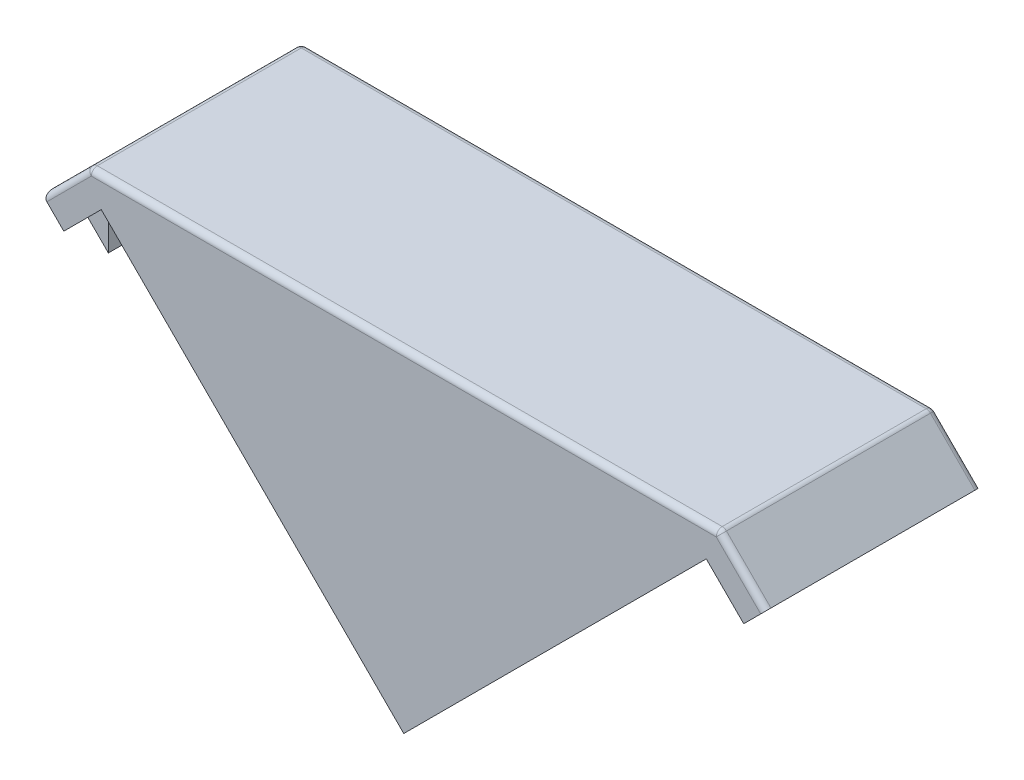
ISO-10303-21;
HEADER;
FILE_DESCRIPTION(('STEP AP214'),'2;1');
FILE_NAME('part.step','',(''),(''),'','','');
FILE_SCHEMA(('AUTOMOTIVE_DESIGN { 1 0 10303 214 1 1 1 1 }'));
ENDSEC;
DATA;
#1=APPLICATION_CONTEXT('core data for automotive mechanical design processes');
#2=APPLICATION_PROTOCOL_DEFINITION('international standard','automotive_design',2000,#1);
#3=PRODUCT_CONTEXT('',#1,'mechanical');
#4=PRODUCT('Part','Part','',(#3));
#5=PRODUCT_RELATED_PRODUCT_CATEGORY('part','',(#4));
#6=PRODUCT_DEFINITION_FORMATION('','',#4);
#7=PRODUCT_DEFINITION_CONTEXT('part definition',#1,'design');
#8=PRODUCT_DEFINITION('design','',#6,#7);
#9=PRODUCT_DEFINITION_SHAPE('','',#8);
#10=(LENGTH_UNIT() NAMED_UNIT(*) SI_UNIT(.MILLI.,.METRE.));
#11=(NAMED_UNIT(*) PLANE_ANGLE_UNIT() SI_UNIT($,.RADIAN.));
#12=(NAMED_UNIT(*) SI_UNIT($,.STERADIAN.) SOLID_ANGLE_UNIT());
#13=UNCERTAINTY_MEASURE_WITH_UNIT(LENGTH_MEASURE(1.E-05),#10,'distance_accuracy_value','');
#14=(GEOMETRIC_REPRESENTATION_CONTEXT(3) GLOBAL_UNCERTAINTY_ASSIGNED_CONTEXT((#13)) GLOBAL_UNIT_ASSIGNED_CONTEXT((#10,
#11,#12)) REPRESENTATION_CONTEXT('',''));
#15=CARTESIAN_POINT('',(0.,0.,0.));
#16=DIRECTION('',(0.,0.,1.));
#17=DIRECTION('',(1.,0.,0.));
#18=AXIS2_PLACEMENT_3D('',#15,#16,#17);
#19=CARTESIAN_POINT('',(-66.6756658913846,-3.19017990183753,36.));
#20=DIRECTION('',(-0.707106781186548,0.707106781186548,0.));
#21=DIRECTION('',(0.,0.,1.));
#22=AXIS2_PLACEMENT_3D('',#19,#20,#21);
#23=PLANE('',#22);
#24=DIRECTION('',(0.,0.,1.));
#25=VECTOR('',#24,1.);
#26=CARTESIAN_POINT('',(-66.604955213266,-3.11946922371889,36.));
#27=LINE('',#26,#25);
#28=CARTESIAN_POINT('',(-66.604955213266,-3.11946922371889,8.5));
#29=VERTEX_POINT('',#28);
#30=CARTESIAN_POINT('',(-66.604955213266,-3.11946922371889,27.5));
#31=VERTEX_POINT('',#30);
#32=EDGE_CURVE('E530',#29,#31,#27,.T.);
#33=ORIENTED_EDGE('',*,*,#32,.F.);
#34=DIRECTION('',(-0.707106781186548,-0.707106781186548,0.));
#35=VECTOR('',#34,1.);
#36=CARTESIAN_POINT('',(-66.6756658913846,-3.19017990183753,8.5));
#37=LINE('',#36,#35);
#38=CARTESIAN_POINT('',(-64.6903845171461,-1.20489852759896,8.5));
#39=VERTEX_POINT('',#38);
#40=EDGE_CURVE('E390',#39,#29,#37,.T.);
#41=ORIENTED_EDGE('',*,*,#40,.F.);
#42=DIRECTION('',(0.,0.,-1.));
#43=VECTOR('',#42,1.);
#44=CARTESIAN_POINT('',(-64.6903845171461,-1.20489852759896,36.));
#45=LINE('',#44,#43);
#46=CARTESIAN_POINT('',(-64.6903845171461,-1.20489852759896,27.5));
#47=VERTEX_POINT('',#46);
#48=EDGE_CURVE('E385',#47,#39,#45,.T.);
#49=ORIENTED_EDGE('',*,*,#48,.F.);
#50=DIRECTION('',(0.707106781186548,0.707106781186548,0.));
#51=VECTOR('',#50,1.);
#52=CARTESIAN_POINT('',(-66.6756658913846,-3.19017990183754,27.5));
#53=LINE('',#52,#51);
#54=EDGE_CURVE('E387',#31,#47,#53,.T.);
#55=ORIENTED_EDGE('',*,*,#54,.F.);
#56=EDGE_LOOP('',(#33,#41,#49,#55));
#57=FACE_BOUND('',#56,.T.);
#58=ADVANCED_FACE('F38',(#57),#23,.F.);
#59=CARTESIAN_POINT('',(-66.6756658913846,-3.19017990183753,36.));
#60=DIRECTION('',(-0.707106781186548,0.707106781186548,0.));
#61=DIRECTION('',(0.,0.,1.));
#62=AXIS2_PLACEMENT_3D('',#59,#60,#61);
#63=PLANE('',#62);
#64=DIRECTION('',(0.,0.,1.));
#65=VECTOR('',#64,1.);
#66=CARTESIAN_POINT('',(-66.604955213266,-3.11946922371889,36.));
#67=LINE('',#66,#65);
#68=CARTESIAN_POINT('',(-66.604955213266,-3.11946922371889,1.));
#69=VERTEX_POINT('',#68);
#70=CARTESIAN_POINT('',(-66.604955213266,-3.11946922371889,4.));
#71=VERTEX_POINT('',#70);
#72=EDGE_CURVE('E439',#69,#71,#67,.T.);
#73=ORIENTED_EDGE('',*,*,#72,.F.);
#74=CARTESIAN_POINT('',(-65.8978484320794,-2.41236244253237,1.));
#75=DIRECTION('',(-0.707106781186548,0.707106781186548,0.));
#76=DIRECTION('',(-0.707106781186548,-0.707106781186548,0.));
#77=AXIS2_PLACEMENT_3D('',#74,#75,#76);
#78=CIRCLE('',#77,1.);
#79=CARTESIAN_POINT('',(-65.8978484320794,-2.41236244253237,0.));
#80=VERTEX_POINT('',#79);
#81=EDGE_CURVE('E11',#69,#80,#78,.F.);
#82=ORIENTED_EDGE('',*,*,#81,.T.);
#83=DIRECTION('',(0.707106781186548,0.707106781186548,0.));
#84=VECTOR('',#83,1.);
#85=CARTESIAN_POINT('',(-66.6756658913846,-3.19017990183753,0.));
#86=LINE('',#85,#84);
#87=CARTESIAN_POINT('',(-60.3619573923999,3.12352859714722,0.));
#88=VERTEX_POINT('',#87);
#89=EDGE_CURVE('E627',#80,#88,#86,.T.);
#90=ORIENTED_EDGE('',*,*,#89,.T.);
#91=DIRECTION('',(0.,0.,-1.));
#92=VECTOR('',#91,1.);
#93=CARTESIAN_POINT('',(-60.3619573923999,3.12352859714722,36.));
#94=LINE('',#93,#92);
#95=CARTESIAN_POINT('',(-60.3619573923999,3.12352859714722,2.));
#96=VERTEX_POINT('',#95);
#97=EDGE_CURVE('E434',#96,#88,#94,.T.);
#98=ORIENTED_EDGE('',*,*,#97,.F.);
#99=DIRECTION('',(0.707106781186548,0.707106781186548,0.));
#100=VECTOR('',#99,1.);
#101=CARTESIAN_POINT('',(-66.6756658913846,-3.19017990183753,2.));
#102=LINE('',#101,#100);
#103=CARTESIAN_POINT('',(-64.6903845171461,-1.20489852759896,2.));
#104=VERTEX_POINT('',#103);
#105=EDGE_CURVE('E491',#104,#96,#102,.T.);
#106=ORIENTED_EDGE('',*,*,#105,.F.);
#107=DIRECTION('',(0.,0.,-1.));
#108=VECTOR('',#107,1.);
#109=CARTESIAN_POINT('',(-64.6903845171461,-1.20489852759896,36.));
#110=LINE('',#109,#108);
#111=CARTESIAN_POINT('',(-64.6903845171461,-1.20489852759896,4.));
#112=VERTEX_POINT('',#111);
#113=EDGE_CURVE('E523',#112,#104,#110,.T.);
#114=ORIENTED_EDGE('',*,*,#113,.F.);
#115=DIRECTION('',(0.707106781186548,0.707106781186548,0.));
#116=VECTOR('',#115,1.);
#117=CARTESIAN_POINT('',(-66.6756658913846,-3.19017990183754,4.));
#118=LINE('',#117,#116);
#119=EDGE_CURVE('E486',#71,#112,#118,.T.);
#120=ORIENTED_EDGE('',*,*,#119,.F.);
#121=EDGE_LOOP('',(#73,#82,#90,#98,#106,#114,#120));
#122=FACE_BOUND('',#121,.T.);
#123=ADVANCED_FACE('F1016',(#122),#63,.F.);
#124=CARTESIAN_POINT('',(-66.6756658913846,-3.19017990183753,36.));
#125=DIRECTION('',(-0.707106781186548,0.707106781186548,0.));
#126=DIRECTION('',(0.,0.,1.));
#127=AXIS2_PLACEMENT_3D('',#124,#125,#126);
#128=PLANE('',#127);
#129=DIRECTION('',(0.,0.,1.));
#130=VECTOR('',#129,1.);
#131=CARTESIAN_POINT('',(-66.604955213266,-3.11946922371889,36.));
#132=LINE('',#131,#130);
#133=CARTESIAN_POINT('',(-66.604955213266,-3.11946922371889,32.));
#134=VERTEX_POINT('',#133);
#135=CARTESIAN_POINT('',(-66.604955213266,-3.11946922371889,36.));
#136=VERTEX_POINT('',#135);
#137=EDGE_CURVE('E611',#134,#136,#132,.T.);
#138=ORIENTED_EDGE('',*,*,#137,.F.);
#139=DIRECTION('',(-0.707106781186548,-0.707106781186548,0.));
#140=VECTOR('',#139,1.);
#141=CARTESIAN_POINT('',(-66.6756658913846,-3.19017990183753,32.));
#142=LINE('',#141,#140);
#143=CARTESIAN_POINT('',(-64.6903845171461,-1.20489852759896,32.));
#144=VERTEX_POINT('',#143);
#145=EDGE_CURVE('E407',#144,#134,#142,.T.);
#146=ORIENTED_EDGE('',*,*,#145,.F.);
#147=DIRECTION('',(0.,0.,-1.));
#148=VECTOR('',#147,1.);
#149=CARTESIAN_POINT('',(-64.6903845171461,-1.20489852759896,36.));
#150=LINE('',#149,#148);
#151=CARTESIAN_POINT('',(-64.6903845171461,-1.20489852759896,34.));
#152=VERTEX_POINT('',#151);
#153=EDGE_CURVE('E524',#152,#144,#150,.T.);
#154=ORIENTED_EDGE('',*,*,#153,.F.);
#155=DIRECTION('',(-0.707106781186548,-0.707106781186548,0.));
#156=VECTOR('',#155,1.);
#157=CARTESIAN_POINT('',(-66.6756658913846,-3.19017990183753,34.));
#158=LINE('',#157,#156);
#159=CARTESIAN_POINT('',(-60.3619573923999,3.12352859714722,34.));
#160=VERTEX_POINT('',#159);
#161=EDGE_CURVE('E577',#160,#152,#158,.T.);
#162=ORIENTED_EDGE('',*,*,#161,.F.);
#163=DIRECTION('',(0.,0.,-1.));
#164=VECTOR('',#163,1.);
#165=CARTESIAN_POINT('',(-60.3619573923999,3.12352859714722,36.));
#166=LINE('',#165,#164);
#167=CARTESIAN_POINT('',(-60.3619573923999,3.12352859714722,36.));
#168=VERTEX_POINT('',#167);
#169=EDGE_CURVE('E482',#168,#160,#166,.T.);
#170=ORIENTED_EDGE('',*,*,#169,.F.);
#171=DIRECTION('',(0.707106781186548,0.707106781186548,0.));
#172=VECTOR('',#171,1.);
#173=CARTESIAN_POINT('',(-66.6756658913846,-3.19017990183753,36.));
#174=LINE('',#173,#172);
#175=EDGE_CURVE('E736',#136,#168,#174,.T.);
#176=ORIENTED_EDGE('',*,*,#175,.F.);
#177=EDGE_LOOP('',(#138,#146,#154,#162,#170,#176));
#178=FACE_BOUND('',#177,.T.);
#179=ADVANCED_FACE('F912',(#178),#128,.F.);
#180=CARTESIAN_POINT('',(-62.4330252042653,8.12352859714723,36.));
#181=DIRECTION('',(0.707106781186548,-0.707106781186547,0.));
#182=DIRECTION('',(0.,0.,-1.));
#183=AXIS2_PLACEMENT_3D('',#180,#181,#182);
#184=PLANE('',#183);
#185=DIRECTION('',(0.,0.,-1.));
#186=VECTOR('',#185,1.);
#187=CARTESIAN_POINT('',(-69.4333823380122,1.12317146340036,36.));
#188=LINE('',#187,#186);
#189=CARTESIAN_POINT('',(-69.4333823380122,1.12317146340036,1.));
#190=VERTEX_POINT('',#189);
#191=CARTESIAN_POINT('',(-69.4333823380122,1.12317146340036,35.));
#192=VERTEX_POINT('',#191);
#193=EDGE_CURVE('E651',#190,#192,#188,.F.);
#194=ORIENTED_EDGE('',*,*,#193,.T.);
#195=DIRECTION('',(-0.707106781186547,-0.707106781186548,0.));
#196=VECTOR('',#195,1.);
#197=CARTESIAN_POINT('',(-62.4330252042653,8.12352859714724,35.));
#198=LINE('',#197,#196);
#199=CARTESIAN_POINT('',(-62.7259184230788,7.83063537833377,35.));
#200=VERTEX_POINT('',#199);
#201=EDGE_CURVE('E657',#192,#200,#198,.F.);
#202=ORIENTED_EDGE('',*,*,#201,.T.);
#203=DIRECTION('',(0.,0.,-1.));
#204=VECTOR('',#203,1.);
#205=CARTESIAN_POINT('',(-62.7259184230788,7.83063537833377,36.));
#206=LINE('',#205,#204);
#207=CARTESIAN_POINT('',(-62.7259184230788,7.83063537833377,1.));
#208=VERTEX_POINT('',#207);
#209=EDGE_CURVE('E655',#200,#208,#206,.T.);
#210=ORIENTED_EDGE('',*,*,#209,.T.);
#211=DIRECTION('',(-0.707106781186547,-0.707106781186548,0.));
#212=VECTOR('',#211,1.);
#213=CARTESIAN_POINT('',(-62.4330252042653,8.12352859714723,1.));
#214=LINE('',#213,#212);
#215=EDGE_CURVE('E653',#208,#190,#214,.T.);
#216=ORIENTED_EDGE('',*,*,#215,.T.);
#217=EDGE_LOOP('',(#194,#202,#210,#216));
#218=FACE_BOUND('',#217,.T.);
#219=ADVANCED_FACE('F927',(#218),#184,.F.);
#220=CARTESIAN_POINT('',(0.,0.,36.));
#221=DIRECTION('',(0.,0.,1.));
#222=DIRECTION('',(1.,0.,0.));
#223=AXIS2_PLACEMENT_3D('',#220,#221,#222);
#224=PLANE('',#223);
#225=DIRECTION('',(-0.707106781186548,-0.707106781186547,0.));
#226=VECTOR('',#225,1.);
#227=CARTESIAN_POINT('',(24.929187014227,-24.9291870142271,36.));
#228=LINE('',#227,#226);
#229=CARTESIAN_POINT('',(49.5673319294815,-0.291042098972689,36.));
#230=VERTEX_POINT('',#229);
#231=CARTESIAN_POINT('',(46.7389048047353,-3.11946922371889,36.));
#232=VERTEX_POINT('',#231);
#233=EDGE_CURVE('E565',#230,#232,#228,.T.);
#234=ORIENTED_EDGE('',*,*,#233,.F.);
#235=DIRECTION('',(-0.707106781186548,0.707106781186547,0.));
#236=VECTOR('',#235,1.);
#237=CARTESIAN_POINT('',(41.8598680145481,7.41642181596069,36.));
#238=LINE('',#237,#236);
#239=CARTESIAN_POINT('',(42.1527612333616,7.12352859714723,36.));
#240=VERTEX_POINT('',#239);
#241=EDGE_CURVE('E629',#230,#240,#238,.T.);
#242=ORIENTED_EDGE('',*,*,#241,.T.);
#243=DIRECTION('',(-1.,0.,0.));
#244=VECTOR('',#243,1.);
#245=CARTESIAN_POINT('',(-62.4330252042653,7.12352859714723,36.));
#246=LINE('',#245,#244);
#247=CARTESIAN_POINT('',(-62.0188116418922,7.12352859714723,36.));
#248=VERTEX_POINT('',#247);
#249=EDGE_CURVE('E626',#240,#248,#246,.T.);
#250=ORIENTED_EDGE('',*,*,#249,.T.);
#251=DIRECTION('',(-0.707106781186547,-0.707106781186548,0.));
#252=VECTOR('',#251,1.);
#253=CARTESIAN_POINT('',(-69.4333823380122,-0.29104209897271,36.));
#254=LINE('',#253,#252);
#255=CARTESIAN_POINT('',(-69.4333823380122,-0.291042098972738,36.));
#256=VERTEX_POINT('',#255);
#257=EDGE_CURVE('E624',#248,#256,#254,.T.);
#258=ORIENTED_EDGE('',*,*,#257,.T.);
#259=DIRECTION('',(0.707106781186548,-0.707106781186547,0.));
#260=VECTOR('',#259,1.);
#261=CARTESIAN_POINT('',(-34.8622122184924,-34.8622122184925,36.));
#262=LINE('',#261,#260);
#263=EDGE_CURVE('E740',#256,#136,#262,.T.);
#264=ORIENTED_EDGE('',*,*,#263,.T.);
#265=ORIENTED_EDGE('',*,*,#175,.T.);
#266=DIRECTION('',(0.707106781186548,-0.707106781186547,0.));
#267=VECTOR('',#266,1.);
#268=CARTESIAN_POINT('',(-9.93302520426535,-47.3054035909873,36.));
#269=LINE('',#268,#267);
#270=CARTESIAN_POINT('',(-9.93302520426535,-47.3054035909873,36.));
#271=VERTEX_POINT('',#270);
#272=EDGE_CURVE('E741',#168,#271,#269,.T.);
#273=ORIENTED_EDGE('',*,*,#272,.T.);
#274=DIRECTION('',(0.707106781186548,0.707106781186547,0.));
#275=VECTOR('',#274,1.);
#276=CARTESIAN_POINT('',(40.4959069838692,3.12352859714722,36.));
#277=LINE('',#276,#275);
#278=CARTESIAN_POINT('',(40.4959069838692,3.12352859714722,36.));
#279=VERTEX_POINT('',#278);
#280=EDGE_CURVE('E447',#271,#279,#277,.T.);
#281=ORIENTED_EDGE('',*,*,#280,.T.);
#282=DIRECTION('',(0.707106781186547,-0.707106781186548,0.));
#283=VECTOR('',#282,1.);
#284=CARTESIAN_POINT('',(46.809615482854,-3.19017990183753,36.));
#285=LINE('',#284,#283);
#286=EDGE_CURVE('E443',#279,#232,#285,.T.);
#287=ORIENTED_EDGE('',*,*,#286,.T.);
#288=EDGE_LOOP('',(#234,#242,#250,#258,#264,#265,#273,#281,#287));
#289=FACE_BOUND('',#288,.T.);
#290=ADVANCED_FACE('F975',(#289),#224,.T.);
#291=CARTESIAN_POINT('',(0.,0.,0.));
#292=DIRECTION('',(0.,0.,1.));
#293=DIRECTION('',(1.,0.,0.));
#294=AXIS2_PLACEMENT_3D('',#291,#292,#293);
#295=PLANE('',#294);
#296=DIRECTION('',(-1.,0.,0.));
#297=VECTOR('',#296,1.);
#298=CARTESIAN_POINT('',(0.,7.12352859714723,0.));
#299=LINE('',#298,#297);
#300=CARTESIAN_POINT('',(-62.0188116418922,7.12352859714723,0.));
#301=VERTEX_POINT('',#300);
#302=CARTESIAN_POINT('',(42.1527612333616,7.12352859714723,0.));
#303=VERTEX_POINT('',#302);
#304=EDGE_CURVE('E664',#301,#303,#299,.F.);
#305=ORIENTED_EDGE('',*,*,#304,.T.);
#306=DIRECTION('',(-0.707106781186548,0.707106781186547,0.));
#307=VECTOR('',#306,1.);
#308=CARTESIAN_POINT('',(24.6381449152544,24.6381449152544,0.));
#309=LINE('',#308,#307);
#310=CARTESIAN_POINT('',(49.5673319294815,-0.291042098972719,0.));
#311=VERTEX_POINT('',#310);
#312=EDGE_CURVE('E666',#303,#311,#309,.F.);
#313=ORIENTED_EDGE('',*,*,#312,.T.);
#314=DIRECTION('',(0.707106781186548,0.707106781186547,0.));
#315=VECTOR('',#314,1.);
#316=CARTESIAN_POINT('',(50.2744387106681,0.416064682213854,0.));
#317=LINE('',#316,#315);
#318=CARTESIAN_POINT('',(46.7389048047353,-3.11946922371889,0.));
#319=VERTEX_POINT('',#318);
#320=EDGE_CURVE('E561',#319,#311,#317,.T.);
#321=ORIENTED_EDGE('',*,*,#320,.F.);
#322=DIRECTION('',(0.707106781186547,-0.707106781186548,0.));
#323=VECTOR('',#322,1.);
#324=CARTESIAN_POINT('',(46.809615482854,-3.19017990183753,0.));
#325=LINE('',#324,#323);
#326=CARTESIAN_POINT('',(40.4959069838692,3.12352859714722,0.));
#327=VERTEX_POINT('',#326);
#328=EDGE_CURVE('E514',#327,#319,#325,.T.);
#329=ORIENTED_EDGE('',*,*,#328,.F.);
#330=DIRECTION('',(1.,0.,0.));
#331=VECTOR('',#330,1.);
#332=CARTESIAN_POINT('',(-60.3619573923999,3.12352859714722,0.));
#333=LINE('',#332,#331);
#334=EDGE_CURVE('E438',#88,#327,#333,.T.);
#335=ORIENTED_EDGE('',*,*,#334,.F.);
#336=ORIENTED_EDGE('',*,*,#89,.F.);
#337=DIRECTION('',(0.707106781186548,-0.707106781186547,0.));
#338=VECTOR('',#337,1.);
#339=CARTESIAN_POINT('',(-69.4333823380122,1.12317146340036,0.));
#340=LINE('',#339,#338);
#341=CARTESIAN_POINT('',(-68.7262755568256,0.416064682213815,0.));
#342=VERTEX_POINT('',#341);
#343=EDGE_CURVE('E662',#80,#342,#340,.F.);
#344=ORIENTED_EDGE('',*,*,#343,.T.);
#345=DIRECTION('',(-0.707106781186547,-0.707106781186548,0.));
#346=VECTOR('',#345,1.);
#347=CARTESIAN_POINT('',(-34.5711701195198,34.5711701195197,0.));
#348=LINE('',#347,#346);
#349=EDGE_CURVE('E660',#342,#301,#348,.F.);
#350=ORIENTED_EDGE('',*,*,#349,.T.);
#351=EDGE_LOOP('',(#305,#313,#321,#329,#335,#336,#344,#350));
#352=FACE_BOUND('',#351,.T.);
#353=ADVANCED_FACE('F950',(#352),#295,.F.);
#354=CARTESIAN_POINT('',(-63.1756658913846,-7.37647140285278,27.5));
#355=DIRECTION('',(-1.,0.,0.));
#356=DIRECTION('',(0.,0.,1.));
#357=AXIS2_PLACEMENT_3D('',#354,#355,#356);
#358=PLANE('',#357);
#359=DIRECTION('',(0.,0.,1.));
#360=VECTOR('',#359,1.);
#361=CARTESIAN_POINT('',(-63.1756658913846,-6.54875854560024,27.5));
#362=LINE('',#361,#360);
#363=CARTESIAN_POINT('',(-63.1756658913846,-6.54875854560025,27.5));
#364=VERTEX_POINT('',#363);
#365=CARTESIAN_POINT('',(-63.1756658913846,-6.54875854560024,32.));
#366=VERTEX_POINT('',#365);
#367=EDGE_CURVE('E605',#364,#366,#362,.T.);
#368=ORIENTED_EDGE('',*,*,#367,.F.);
#369=DIRECTION('',(0.,1.,0.));
#370=VECTOR('',#369,1.);
#371=CARTESIAN_POINT('',(-63.1756658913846,-7.37647140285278,27.5));
#372=LINE('',#371,#370);
#373=CARTESIAN_POINT('',(-63.1756658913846,3.13824722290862,27.5));
#374=VERTEX_POINT('',#373);
#375=EDGE_CURVE('E448',#364,#374,#372,.T.);
#376=ORIENTED_EDGE('',*,*,#375,.T.);
#377=DIRECTION('',(0.,0.,1.));
#378=VECTOR('',#377,1.);
#379=CARTESIAN_POINT('',(-63.1756658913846,3.13824722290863,0.));
#380=LINE('',#379,#378);
#381=CARTESIAN_POINT('',(-63.1756658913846,3.13824722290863,32.));
#382=VERTEX_POINT('',#381);
#383=EDGE_CURVE('E495',#374,#382,#380,.T.);
#384=ORIENTED_EDGE('',*,*,#383,.T.);
#385=DIRECTION('',(0.,1.,0.));
#386=VECTOR('',#385,1.);
#387=CARTESIAN_POINT('',(-63.1756658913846,-7.37647140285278,32.));
#388=LINE('',#387,#386);
#389=EDGE_CURVE('E492',#366,#382,#388,.T.);
#390=ORIENTED_EDGE('',*,*,#389,.F.);
#391=EDGE_LOOP('',(#368,#376,#384,#390));
#392=FACE_BOUND('',#391,.T.);
#393=ADVANCED_FACE('F905',(#392),#358,.F.);
#394=CARTESIAN_POINT('',(-63.1756658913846,-7.37647140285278,32.));
#395=DIRECTION('',(0.,0.,-1.));
#396=DIRECTION('',(0.,-1.,0.));
#397=AXIS2_PLACEMENT_3D('',#394,#395,#396);
#398=PLANE('',#397);
#399=DIRECTION('',(-0.707106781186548,0.707106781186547,0.));
#400=VECTOR('',#399,1.);
#401=CARTESIAN_POINT('',(-62.7618094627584,-6.96261497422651,32.));
#402=LINE('',#401,#400);
#403=EDGE_CURVE('E612',#366,#134,#402,.T.);
#404=ORIENTED_EDGE('',*,*,#403,.F.);
#405=ORIENTED_EDGE('',*,*,#389,.T.);
#406=DIRECTION('',(-0.707106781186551,-0.707106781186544,0.));
#407=VECTOR('',#406,1.);
#408=CARTESIAN_POINT('',(-60.690384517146,5.62352859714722,32.));
#409=LINE('',#408,#407);
#410=CARTESIAN_POINT('',(-64.6903845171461,1.62352859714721,32.));
#411=VERTEX_POINT('',#410);
#412=EDGE_CURVE('E496',#382,#411,#409,.T.);
#413=ORIENTED_EDGE('',*,*,#412,.T.);
#414=DIRECTION('',(0.,1.,0.));
#415=VECTOR('',#414,1.);
#416=CARTESIAN_POINT('',(-64.6903845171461,-32.8764714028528,32.));
#417=LINE('',#416,#415);
#418=EDGE_CURVE('E536',#144,#411,#417,.T.);
#419=ORIENTED_EDGE('',*,*,#418,.F.);
#420=ORIENTED_EDGE('',*,*,#145,.T.);
#421=EDGE_LOOP('',(#404,#405,#413,#419,#420));
#422=FACE_BOUND('',#421,.T.);
#423=ADVANCED_FACE('F907',(#422),#398,.F.);
#424=CARTESIAN_POINT('',(-63.1756658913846,-7.37647140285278,27.5));
#425=DIRECTION('',(0.,0.,1.));
#426=DIRECTION('',(1.,0.,0.));
#427=AXIS2_PLACEMENT_3D('',#424,#425,#426);
#428=PLANE('',#427);
#429=DIRECTION('',(0.707106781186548,-0.707106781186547,0.));
#430=VECTOR('',#429,1.);
#431=CARTESIAN_POINT('',(-62.7618094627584,-6.96261497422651,27.5));
#432=LINE('',#431,#430);
#433=EDGE_CURVE('E405',#31,#364,#432,.T.);
#434=ORIENTED_EDGE('',*,*,#433,.F.);
#435=ORIENTED_EDGE('',*,*,#54,.T.);
#436=DIRECTION('',(0.,-1.,0.));
#437=VECTOR('',#436,1.);
#438=CARTESIAN_POINT('',(-64.6903845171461,-32.8764714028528,27.5));
#439=LINE('',#438,#437);
#440=CARTESIAN_POINT('',(-64.6903845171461,1.62352859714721,27.5));
#441=VERTEX_POINT('',#440);
#442=EDGE_CURVE('E401',#441,#47,#439,.T.);
#443=ORIENTED_EDGE('',*,*,#442,.F.);
#444=DIRECTION('',(0.707106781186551,0.707106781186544,0.));
#445=VECTOR('',#444,1.);
#446=CARTESIAN_POINT('',(-60.690384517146,5.62352859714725,27.5));
#447=LINE('',#446,#445);
#448=EDGE_CURVE('E408',#441,#374,#447,.T.);
#449=ORIENTED_EDGE('',*,*,#448,.T.);
#450=ORIENTED_EDGE('',*,*,#375,.F.);
#451=EDGE_LOOP('',(#434,#435,#443,#449,#450));
#452=FACE_BOUND('',#451,.T.);
#453=ADVANCED_FACE('F399',(#452),#428,.F.);
#454=CARTESIAN_POINT('',(-63.1756658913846,-7.37647140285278,8.5));
#455=DIRECTION('',(-1.,0.,0.));
#456=DIRECTION('',(0.,0.,1.));
#457=AXIS2_PLACEMENT_3D('',#454,#455,#456);
#458=PLANE('',#457);
#459=DIRECTION('',(0.,0.,1.));
#460=VECTOR('',#459,1.);
#461=CARTESIAN_POINT('',(-63.1756658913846,-6.54875854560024,8.5));
#462=LINE('',#461,#460);
#463=CARTESIAN_POINT('',(-63.1756658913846,-6.54875854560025,4.));
#464=VERTEX_POINT('',#463);
#465=CARTESIAN_POINT('',(-63.1756658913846,-6.54875854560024,8.5));
#466=VERTEX_POINT('',#465);
#467=EDGE_CURVE('E540',#464,#466,#462,.T.);
#468=ORIENTED_EDGE('',*,*,#467,.F.);
#469=DIRECTION('',(0.,1.,0.));
#470=VECTOR('',#469,1.);
#471=CARTESIAN_POINT('',(-63.1756658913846,-7.37647140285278,4.));
#472=LINE('',#471,#470);
#473=CARTESIAN_POINT('',(-63.1756658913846,3.13824722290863,4.));
#474=VERTEX_POINT('',#473);
#475=EDGE_CURVE('E464',#464,#474,#472,.T.);
#476=ORIENTED_EDGE('',*,*,#475,.T.);
#477=DIRECTION('',(0.,0.,1.));
#478=VECTOR('',#477,1.);
#479=CARTESIAN_POINT('',(-63.1756658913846,3.13824722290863,0.));
#480=LINE('',#479,#478);
#481=CARTESIAN_POINT('',(-63.1756658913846,3.13824722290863,8.5));
#482=VERTEX_POINT('',#481);
#483=EDGE_CURVE('E460',#474,#482,#480,.T.);
#484=ORIENTED_EDGE('',*,*,#483,.T.);
#485=DIRECTION('',(0.,1.,0.));
#486=VECTOR('',#485,1.);
#487=CARTESIAN_POINT('',(-63.1756658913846,-7.37647140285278,8.5));
#488=LINE('',#487,#486);
#489=EDGE_CURVE('E465',#466,#482,#488,.T.);
#490=ORIENTED_EDGE('',*,*,#489,.F.);
#491=EDGE_LOOP('',(#468,#476,#484,#490));
#492=FACE_BOUND('',#491,.T.);
#493=ADVANCED_FACE('F898',(#492),#458,.F.);
#494=CARTESIAN_POINT('',(-63.1756658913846,-7.37647140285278,8.5));
#495=DIRECTION('',(0.,0.,-1.));
#496=DIRECTION('',(0.,-1.,0.));
#497=AXIS2_PLACEMENT_3D('',#494,#495,#496);
#498=PLANE('',#497);
#499=DIRECTION('',(-0.707106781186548,0.707106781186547,0.));
#500=VECTOR('',#499,1.);
#501=CARTESIAN_POINT('',(-62.7618094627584,-6.96261497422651,8.5));
#502=LINE('',#501,#500);
#503=EDGE_CURVE('E533',#466,#29,#502,.T.);
#504=ORIENTED_EDGE('',*,*,#503,.F.);
#505=ORIENTED_EDGE('',*,*,#489,.T.);
#506=DIRECTION('',(-0.707106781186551,-0.707106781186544,0.));
#507=VECTOR('',#506,1.);
#508=CARTESIAN_POINT('',(-60.690384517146,5.62352859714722,8.5));
#509=LINE('',#508,#507);
#510=CARTESIAN_POINT('',(-64.6903845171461,1.62352859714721,8.5));
#511=VERTEX_POINT('',#510);
#512=EDGE_CURVE('E485',#482,#511,#509,.T.);
#513=ORIENTED_EDGE('',*,*,#512,.T.);
#514=DIRECTION('',(0.,1.,0.));
#515=VECTOR('',#514,1.);
#516=CARTESIAN_POINT('',(-64.6903845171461,-32.8764714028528,8.5));
#517=LINE('',#516,#515);
#518=EDGE_CURVE('E396',#39,#511,#517,.T.);
#519=ORIENTED_EDGE('',*,*,#518,.F.);
#520=ORIENTED_EDGE('',*,*,#40,.T.);
#521=EDGE_LOOP('',(#504,#505,#513,#519,#520));
#522=FACE_BOUND('',#521,.T.);
#523=ADVANCED_FACE('F893',(#522),#498,.F.);
#524=CARTESIAN_POINT('',(-63.1756658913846,-7.37647140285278,4.));
#525=DIRECTION('',(0.,0.,1.));
#526=DIRECTION('',(1.,0.,0.));
#527=AXIS2_PLACEMENT_3D('',#524,#525,#526);
#528=PLANE('',#527);
#529=DIRECTION('',(0.707106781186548,-0.707106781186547,0.));
#530=VECTOR('',#529,1.);
#531=CARTESIAN_POINT('',(-62.7618094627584,-6.96261497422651,4.));
#532=LINE('',#531,#530);
#533=EDGE_CURVE('E442',#71,#464,#532,.T.);
#534=ORIENTED_EDGE('',*,*,#533,.F.);
#535=ORIENTED_EDGE('',*,*,#119,.T.);
#536=DIRECTION('',(0.,-1.,0.));
#537=VECTOR('',#536,1.);
#538=CARTESIAN_POINT('',(-64.6903845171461,-32.8764714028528,4.));
#539=LINE('',#538,#537);
#540=CARTESIAN_POINT('',(-64.6903845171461,1.62352859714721,4.));
#541=VERTEX_POINT('',#540);
#542=EDGE_CURVE('E424',#541,#112,#539,.T.);
#543=ORIENTED_EDGE('',*,*,#542,.F.);
#544=DIRECTION('',(0.707106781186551,0.707106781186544,0.));
#545=VECTOR('',#544,1.);
#546=CARTESIAN_POINT('',(-60.690384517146,5.62352859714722,4.));
#547=LINE('',#546,#545);
#548=EDGE_CURVE('E395',#541,#474,#547,.T.);
#549=ORIENTED_EDGE('',*,*,#548,.T.);
#550=ORIENTED_EDGE('',*,*,#475,.F.);
#551=EDGE_LOOP('',(#534,#535,#543,#549,#550));
#552=FACE_BOUND('',#551,.T.);
#553=ADVANCED_FACE('F1215',(#552),#528,.F.);
#554=CARTESIAN_POINT('',(-64.6903845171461,-32.8764714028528,34.));
#555=DIRECTION('',(1.,0.,0.));
#556=DIRECTION('',(0.,0.,1.));
#557=AXIS2_PLACEMENT_3D('',#554,#555,#556);
#558=PLANE('',#557);
#559=ORIENTED_EDGE('',*,*,#48,.T.);
#560=ORIENTED_EDGE('',*,*,#518,.T.);
#561=DIRECTION('',(0.,0.,1.));
#562=VECTOR('',#561,1.);
#563=CARTESIAN_POINT('',(-64.6903845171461,1.62352859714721,34.));
#564=LINE('',#563,#562);
#565=EDGE_CURVE('E413',#511,#441,#564,.T.);
#566=ORIENTED_EDGE('',*,*,#565,.T.);
#567=ORIENTED_EDGE('',*,*,#442,.T.);
#568=EDGE_LOOP('',(#559,#560,#566,#567));
#569=FACE_BOUND('',#568,.T.);
#570=ADVANCED_FACE('F411',(#569),#558,.T.);
#571=CARTESIAN_POINT('',(-64.6903845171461,-32.8764714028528,34.));
#572=DIRECTION('',(1.,0.,0.));
#573=DIRECTION('',(0.,0.,1.));
#574=AXIS2_PLACEMENT_3D('',#571,#572,#573);
#575=PLANE('',#574);
#576=DIRECTION('',(0.,0.,1.));
#577=VECTOR('',#576,1.);
#578=CARTESIAN_POINT('',(-64.6903845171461,1.62352859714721,34.));
#579=LINE('',#578,#577);
#580=CARTESIAN_POINT('',(-64.6903845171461,1.62352859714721,2.));
#581=VERTEX_POINT('',#580);
#582=EDGE_CURVE('E415',#581,#541,#579,.T.);
#583=ORIENTED_EDGE('',*,*,#582,.T.);
#584=ORIENTED_EDGE('',*,*,#542,.T.);
#585=ORIENTED_EDGE('',*,*,#113,.T.);
#586=DIRECTION('',(0.,1.,0.));
#587=VECTOR('',#586,1.);
#588=CARTESIAN_POINT('',(-64.6903845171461,-32.8764714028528,2.));
#589=LINE('',#588,#587);
#590=EDGE_CURVE('E520',#104,#581,#589,.T.);
#591=ORIENTED_EDGE('',*,*,#590,.T.);
#592=EDGE_LOOP('',(#583,#584,#585,#591));
#593=FACE_BOUND('',#592,.T.);
#594=ADVANCED_FACE('F1214',(#593),#575,.T.);
#595=CARTESIAN_POINT('',(-60.690384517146,5.62352859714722,0.));
#596=DIRECTION('',(0.707106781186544,-0.707106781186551,0.));
#597=DIRECTION('',(0.,0.,-1.));
#598=AXIS2_PLACEMENT_3D('',#595,#596,#597);
#599=PLANE('',#598);
#600=ORIENTED_EDGE('',*,*,#512,.F.);
#601=ORIENTED_EDGE('',*,*,#483,.F.);
#602=ORIENTED_EDGE('',*,*,#548,.F.);
#603=ORIENTED_EDGE('',*,*,#582,.F.);
#604=DIRECTION('',(-0.707106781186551,-0.707106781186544,0.));
#605=VECTOR('',#604,1.);
#606=CARTESIAN_POINT('',(-81.940384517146,-15.6264714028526,2.));
#607=LINE('',#606,#605);
#608=CARTESIAN_POINT('',(-60.690384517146,5.62352859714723,2.));
#609=VERTEX_POINT('',#608);
#610=EDGE_CURVE('E487',#609,#581,#607,.T.);
#611=ORIENTED_EDGE('',*,*,#610,.F.);
#612=DIRECTION('',(0.,0.,-1.));
#613=VECTOR('',#612,1.);
#614=CARTESIAN_POINT('',(-60.690384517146,5.62352859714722,2.));
#615=LINE('',#614,#613);
#616=CARTESIAN_POINT('',(-60.690384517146,5.62352859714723,34.));
#617=VERTEX_POINT('',#616);
#618=EDGE_CURVE('E449',#617,#609,#615,.T.);
#619=ORIENTED_EDGE('',*,*,#618,.F.);
#620=DIRECTION('',(0.707106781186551,0.707106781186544,0.));
#621=VECTOR('',#620,1.);
#622=CARTESIAN_POINT('',(-81.940384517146,-15.6264714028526,34.));
#623=LINE('',#622,#621);
#624=CARTESIAN_POINT('',(-64.6903845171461,1.62352859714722,34.));
#625=VERTEX_POINT('',#624);
#626=EDGE_CURVE('E792',#625,#617,#623,.T.);
#627=ORIENTED_EDGE('',*,*,#626,.F.);
#628=DIRECTION('',(0.,0.,1.));
#629=VECTOR('',#628,1.);
#630=CARTESIAN_POINT('',(-64.6903845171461,1.62352859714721,34.));
#631=LINE('',#630,#629);
#632=EDGE_CURVE('E518',#411,#625,#631,.T.);
#633=ORIENTED_EDGE('',*,*,#632,.F.);
#634=ORIENTED_EDGE('',*,*,#412,.F.);
#635=ORIENTED_EDGE('',*,*,#383,.F.);
#636=ORIENTED_EDGE('',*,*,#448,.F.);
#637=ORIENTED_EDGE('',*,*,#565,.F.);
#638=EDGE_LOOP('',(#600,#601,#602,#603,#611,#619,#627,#633,#634,#635,#636,#637));
#639=FACE_BOUND('',#638,.T.);
#640=ADVANCED_FACE('F900',(#639),#599,.T.);
#641=CARTESIAN_POINT('',(-64.6903845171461,-32.8764714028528,34.));
#642=DIRECTION('',(1.,0.,0.));
#643=DIRECTION('',(0.,0.,1.));
#644=AXIS2_PLACEMENT_3D('',#641,#642,#643);
#645=PLANE('',#644);
#646=ORIENTED_EDGE('',*,*,#153,.T.);
#647=ORIENTED_EDGE('',*,*,#418,.T.);
#648=ORIENTED_EDGE('',*,*,#632,.T.);
#649=DIRECTION('',(0.,1.,0.));
#650=VECTOR('',#649,1.);
#651=CARTESIAN_POINT('',(-64.6903845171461,-32.8764714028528,34.));
#652=LINE('',#651,#650);
#653=EDGE_CURVE('E598',#152,#625,#652,.T.);
#654=ORIENTED_EDGE('',*,*,#653,.F.);
#655=EDGE_LOOP('',(#646,#647,#648,#654));
#656=FACE_BOUND('',#655,.T.);
#657=ADVANCED_FACE('F1039',(#656),#645,.T.);
#658=CARTESIAN_POINT('',(46.809615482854,-3.19017990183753,36.));
#659=DIRECTION('',(0.707106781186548,0.707106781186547,0.));
#660=DIRECTION('',(0.,0.,-1.));
#661=AXIS2_PLACEMENT_3D('',#658,#659,#660);
#662=PLANE('',#661);
#663=ORIENTED_EDGE('',*,*,#328,.T.);
#664=DIRECTION('',(0.,0.,1.));
#665=VECTOR('',#664,1.);
#666=CARTESIAN_POINT('',(46.7389048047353,-3.11946922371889,36.));
#667=LINE('',#666,#665);
#668=CARTESIAN_POINT('',(46.7389048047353,-3.11946922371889,4.));
#669=VERTEX_POINT('',#668);
#670=EDGE_CURVE('E519',#319,#669,#667,.T.);
#671=ORIENTED_EDGE('',*,*,#670,.T.);
#672=DIRECTION('',(0.707106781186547,-0.707106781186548,0.));
#673=VECTOR('',#672,1.);
#674=CARTESIAN_POINT('',(46.809615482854,-3.19017990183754,4.));
#675=LINE('',#674,#673);
#676=CARTESIAN_POINT('',(44.809615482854,-1.19017990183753,4.));
#677=VERTEX_POINT('',#676);
#678=EDGE_CURVE('E549',#677,#669,#675,.T.);
#679=ORIENTED_EDGE('',*,*,#678,.F.);
#680=DIRECTION('',(0.,0.,1.));
#681=VECTOR('',#680,1.);
#682=CARTESIAN_POINT('',(44.809615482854,-1.19017990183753,36.));
#683=LINE('',#682,#681);
#684=CARTESIAN_POINT('',(44.809615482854,-1.19017990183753,2.));
#685=VERTEX_POINT('',#684);
#686=EDGE_CURVE('E742',#685,#677,#683,.T.);
#687=ORIENTED_EDGE('',*,*,#686,.F.);
#688=DIRECTION('',(0.707106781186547,-0.707106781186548,0.));
#689=VECTOR('',#688,1.);
#690=CARTESIAN_POINT('',(46.809615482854,-3.19017990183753,2.));
#691=LINE('',#690,#689);
#692=CARTESIAN_POINT('',(40.4959069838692,3.12352859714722,2.));
#693=VERTEX_POINT('',#692);
#694=EDGE_CURVE('E506',#693,#685,#691,.T.);
#695=ORIENTED_EDGE('',*,*,#694,.F.);
#696=DIRECTION('',(0.,0.,-1.));
#697=VECTOR('',#696,1.);
#698=CARTESIAN_POINT('',(40.4959069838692,3.12352859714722,36.));
#699=LINE('',#698,#697);
#700=EDGE_CURVE('E584',#693,#327,#699,.T.);
#701=ORIENTED_EDGE('',*,*,#700,.T.);
#702=EDGE_LOOP('',(#663,#671,#679,#687,#695,#701));
#703=FACE_BOUND('',#702,.T.);
#704=ADVANCED_FACE('F1005',(#703),#662,.F.);
#705=CARTESIAN_POINT('',(46.809615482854,-3.19017990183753,36.));
#706=DIRECTION('',(0.707106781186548,0.707106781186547,0.));
#707=DIRECTION('',(0.,0.,-1.));
#708=AXIS2_PLACEMENT_3D('',#705,#706,#707);
#709=PLANE('',#708);
#710=DIRECTION('',(-0.707106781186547,0.707106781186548,0.));
#711=VECTOR('',#710,1.);
#712=CARTESIAN_POINT('',(46.809615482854,-3.19017990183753,8.5));
#713=LINE('',#712,#711);
#714=CARTESIAN_POINT('',(46.7389048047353,-3.11946922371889,8.5));
#715=VERTEX_POINT('',#714);
#716=CARTESIAN_POINT('',(44.809615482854,-1.19017990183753,8.5));
#717=VERTEX_POINT('',#716);
#718=EDGE_CURVE('E770',#715,#717,#713,.T.);
#719=ORIENTED_EDGE('',*,*,#718,.F.);
#720=DIRECTION('',(0.,0.,1.));
#721=VECTOR('',#720,1.);
#722=CARTESIAN_POINT('',(46.7389048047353,-3.11946922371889,36.));
#723=LINE('',#722,#721);
#724=CARTESIAN_POINT('',(46.7389048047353,-3.11946922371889,27.5));
#725=VERTEX_POINT('',#724);
#726=EDGE_CURVE('E728',#715,#725,#723,.T.);
#727=ORIENTED_EDGE('',*,*,#726,.T.);
#728=DIRECTION('',(0.707106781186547,-0.707106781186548,0.));
#729=VECTOR('',#728,1.);
#730=CARTESIAN_POINT('',(46.809615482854,-3.19017990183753,27.5));
#731=LINE('',#730,#729);
#732=CARTESIAN_POINT('',(44.809615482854,-1.19017990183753,27.5));
#733=VERTEX_POINT('',#732);
#734=EDGE_CURVE('E501',#733,#725,#731,.T.);
#735=ORIENTED_EDGE('',*,*,#734,.F.);
#736=DIRECTION('',(0.,0.,1.));
#737=VECTOR('',#736,1.);
#738=CARTESIAN_POINT('',(44.809615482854,-1.19017990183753,36.));
#739=LINE('',#738,#737);
#740=EDGE_CURVE('E585',#717,#733,#739,.T.);
#741=ORIENTED_EDGE('',*,*,#740,.F.);
#742=EDGE_LOOP('',(#719,#727,#735,#741));
#743=FACE_BOUND('',#742,.T.);
#744=ADVANCED_FACE('F990',(#743),#709,.F.);
#745=CARTESIAN_POINT('',(44.809615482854,-32.8764714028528,34.));
#746=DIRECTION('',(-1.,0.,0.));
#747=DIRECTION('',(0.,0.,1.));
#748=AXIS2_PLACEMENT_3D('',#745,#746,#747);
#749=PLANE('',#748);
#750=ORIENTED_EDGE('',*,*,#686,.T.);
#751=DIRECTION('',(0.,1.,0.));
#752=VECTOR('',#751,1.);
#753=CARTESIAN_POINT('',(44.809615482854,-32.8764714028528,4.));
#754=LINE('',#753,#752);
#755=CARTESIAN_POINT('',(44.809615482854,1.62352859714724,4.));
#756=VERTEX_POINT('',#755);
#757=EDGE_CURVE('E746',#677,#756,#754,.T.);
#758=ORIENTED_EDGE('',*,*,#757,.T.);
#759=DIRECTION('',(0.,0.,-1.));
#760=VECTOR('',#759,1.);
#761=CARTESIAN_POINT('',(44.809615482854,1.62352859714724,2.));
#762=LINE('',#761,#760);
#763=CARTESIAN_POINT('',(44.809615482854,1.62352859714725,2.));
#764=VERTEX_POINT('',#763);
#765=EDGE_CURVE('E470',#756,#764,#762,.T.);
#766=ORIENTED_EDGE('',*,*,#765,.T.);
#767=DIRECTION('',(0.,1.,0.));
#768=VECTOR('',#767,1.);
#769=CARTESIAN_POINT('',(44.809615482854,-32.8764714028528,2.));
#770=LINE('',#769,#768);
#771=EDGE_CURVE('E510',#685,#764,#770,.T.);
#772=ORIENTED_EDGE('',*,*,#771,.F.);
#773=EDGE_LOOP('',(#750,#758,#766,#772));
#774=FACE_BOUND('',#773,.T.);
#775=ADVANCED_FACE('F1237',(#774),#749,.T.);
#776=CARTESIAN_POINT('',(44.809615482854,-32.8764714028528,34.));
#777=DIRECTION('',(-1.,0.,0.));
#778=DIRECTION('',(0.,0.,1.));
#779=AXIS2_PLACEMENT_3D('',#776,#777,#778);
#780=PLANE('',#779);
#781=DIRECTION('',(0.,0.,-1.));
#782=VECTOR('',#781,1.);
#783=CARTESIAN_POINT('',(44.809615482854,1.62352859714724,2.));
#784=LINE('',#783,#782);
#785=CARTESIAN_POINT('',(44.809615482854,1.62352859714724,27.5));
#786=VERTEX_POINT('',#785);
#787=CARTESIAN_POINT('',(44.809615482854,1.62352859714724,8.5));
#788=VERTEX_POINT('',#787);
#789=EDGE_CURVE('E466',#786,#788,#784,.T.);
#790=ORIENTED_EDGE('',*,*,#789,.T.);
#791=DIRECTION('',(0.,-1.,0.));
#792=VECTOR('',#791,1.);
#793=CARTESIAN_POINT('',(44.809615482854,-32.8764714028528,8.5));
#794=LINE('',#793,#792);
#795=EDGE_CURVE('E428',#788,#717,#794,.T.);
#796=ORIENTED_EDGE('',*,*,#795,.T.);
#797=ORIENTED_EDGE('',*,*,#740,.T.);
#798=DIRECTION('',(0.,1.,0.));
#799=VECTOR('',#798,1.);
#800=CARTESIAN_POINT('',(44.809615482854,-32.8764714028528,27.5));
#801=LINE('',#800,#799);
#802=EDGE_CURVE('E589',#733,#786,#801,.T.);
#803=ORIENTED_EDGE('',*,*,#802,.T.);
#804=EDGE_LOOP('',(#790,#796,#797,#803));
#805=FACE_BOUND('',#804,.T.);
#806=ADVANCED_FACE('F1321',(#805),#780,.T.);
#807=CARTESIAN_POINT('',(40.8096154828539,5.62352859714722,0.));
#808=DIRECTION('',(-0.707106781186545,-0.707106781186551,0.));
#809=DIRECTION('',(-0.707106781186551,0.707106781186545,0.));
#810=AXIS2_PLACEMENT_3D('',#807,#808,#809);
#811=PLANE('',#810);
#812=DIRECTION('',(0.707106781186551,-0.707106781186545,0.));
#813=VECTOR('',#812,1.);
#814=CARTESIAN_POINT('',(40.8096154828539,5.62352859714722,4.));
#815=LINE('',#814,#813);
#816=CARTESIAN_POINT('',(43.309615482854,3.12352859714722,4.));
#817=VERTEX_POINT('',#816);
#818=EDGE_CURVE('E454',#817,#756,#815,.T.);
#819=ORIENTED_EDGE('',*,*,#818,.F.);
#820=DIRECTION('',(0.,0.,-1.));
#821=VECTOR('',#820,1.);
#822=CARTESIAN_POINT('',(43.309615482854,3.12352859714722,0.));
#823=LINE('',#822,#821);
#824=CARTESIAN_POINT('',(43.309615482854,3.12352859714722,8.5));
#825=VERTEX_POINT('',#824);
#826=EDGE_CURVE('E544',#825,#817,#823,.T.);
#827=ORIENTED_EDGE('',*,*,#826,.F.);
#828=DIRECTION('',(-0.707106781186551,0.707106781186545,0.));
#829=VECTOR('',#828,1.);
#830=CARTESIAN_POINT('',(40.8096154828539,5.62352859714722,8.5));
#831=LINE('',#830,#829);
#832=EDGE_CURVE('E441',#788,#825,#831,.T.);
#833=ORIENTED_EDGE('',*,*,#832,.F.);
#834=ORIENTED_EDGE('',*,*,#789,.F.);
#835=DIRECTION('',(0.707106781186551,-0.707106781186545,0.));
#836=VECTOR('',#835,1.);
#837=CARTESIAN_POINT('',(40.8096154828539,5.62352859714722,27.5));
#838=LINE('',#837,#836);
#839=CARTESIAN_POINT('',(43.309615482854,3.12352859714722,27.5));
#840=VERTEX_POINT('',#839);
#841=EDGE_CURVE('E593',#840,#786,#838,.T.);
#842=ORIENTED_EDGE('',*,*,#841,.F.);
#843=DIRECTION('',(0.,0.,-1.));
#844=VECTOR('',#843,1.);
#845=CARTESIAN_POINT('',(43.309615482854,3.12352859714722,0.));
#846=LINE('',#845,#844);
#847=CARTESIAN_POINT('',(43.309615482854,3.12352859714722,32.));
#848=VERTEX_POINT('',#847);
#849=EDGE_CURVE('E497',#848,#840,#846,.T.);
#850=ORIENTED_EDGE('',*,*,#849,.F.);
#851=DIRECTION('',(-0.707106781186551,0.707106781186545,0.));
#852=VECTOR('',#851,1.);
#853=CARTESIAN_POINT('',(40.8096154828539,5.62352859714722,32.));
#854=LINE('',#853,#852);
#855=CARTESIAN_POINT('',(44.809615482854,1.62352859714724,32.));
#856=VERTEX_POINT('',#855);
#857=EDGE_CURVE('E471',#856,#848,#854,.T.);
#858=ORIENTED_EDGE('',*,*,#857,.F.);
#859=DIRECTION('',(0.,0.,-1.));
#860=VECTOR('',#859,1.);
#861=CARTESIAN_POINT('',(44.809615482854,1.62352859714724,2.));
#862=LINE('',#861,#860);
#863=CARTESIAN_POINT('',(44.809615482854,1.62352859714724,34.));
#864=VERTEX_POINT('',#863);
#865=EDGE_CURVE('E569',#864,#856,#862,.T.);
#866=ORIENTED_EDGE('',*,*,#865,.F.);
#867=DIRECTION('',(0.707106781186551,-0.707106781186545,0.));
#868=VECTOR('',#867,1.);
#869=CARTESIAN_POINT('',(7.30961548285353,39.1235285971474,34.));
#870=LINE('',#869,#868);
#871=CARTESIAN_POINT('',(40.8096154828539,5.62352859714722,34.));
#872=VERTEX_POINT('',#871);
#873=EDGE_CURVE('E789',#872,#864,#870,.T.);
#874=ORIENTED_EDGE('',*,*,#873,.F.);
#875=DIRECTION('',(0.,0.,1.));
#876=VECTOR('',#875,1.);
#877=CARTESIAN_POINT('',(40.8096154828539,5.62352859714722,34.));
#878=LINE('',#877,#876);
#879=CARTESIAN_POINT('',(40.8096154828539,5.62352859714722,2.));
#880=VERTEX_POINT('',#879);
#881=EDGE_CURVE('E479',#880,#872,#878,.T.);
#882=ORIENTED_EDGE('',*,*,#881,.F.);
#883=DIRECTION('',(-0.707106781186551,0.707106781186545,0.));
#884=VECTOR('',#883,1.);
#885=CARTESIAN_POINT('',(7.30961548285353,39.1235285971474,2.));
#886=LINE('',#885,#884);
#887=EDGE_CURVE('E594',#764,#880,#886,.T.);
#888=ORIENTED_EDGE('',*,*,#887,.F.);
#889=ORIENTED_EDGE('',*,*,#765,.F.);
#890=EDGE_LOOP('',(#819,#827,#833,#834,#842,#850,#858,#866,#874,#882,#888,#889));
#891=FACE_BOUND('',#890,.T.);
#892=ADVANCED_FACE('F876',(#891),#811,.T.);
#893=CARTESIAN_POINT('',(46.809615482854,-3.19017990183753,36.));
#894=DIRECTION('',(0.707106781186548,0.707106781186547,0.));
#895=DIRECTION('',(0.,0.,-1.));
#896=AXIS2_PLACEMENT_3D('',#893,#894,#895);
#897=PLANE('',#896);
#898=DIRECTION('',(-0.707106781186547,0.707106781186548,0.));
#899=VECTOR('',#898,1.);
#900=CARTESIAN_POINT('',(46.809615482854,-3.19017990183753,32.));
#901=LINE('',#900,#899);
#902=CARTESIAN_POINT('',(46.7389048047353,-3.11946922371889,32.));
#903=VERTEX_POINT('',#902);
#904=CARTESIAN_POINT('',(44.809615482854,-1.19017990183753,32.));
#905=VERTEX_POINT('',#904);
#906=EDGE_CURVE('E474',#903,#905,#901,.T.);
#907=ORIENTED_EDGE('',*,*,#906,.F.);
#908=DIRECTION('',(0.,0.,1.));
#909=VECTOR('',#908,1.);
#910=CARTESIAN_POINT('',(46.7389048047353,-3.11946922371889,36.));
#911=LINE('',#910,#909);
#912=EDGE_CURVE('E775',#903,#232,#911,.T.);
#913=ORIENTED_EDGE('',*,*,#912,.T.);
#914=ORIENTED_EDGE('',*,*,#286,.F.);
#915=DIRECTION('',(0.,0.,-1.));
#916=VECTOR('',#915,1.);
#917=CARTESIAN_POINT('',(40.4959069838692,3.12352859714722,36.));
#918=LINE('',#917,#916);
#919=CARTESIAN_POINT('',(40.4959069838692,3.12352859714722,34.));
#920=VERTEX_POINT('',#919);
#921=EDGE_CURVE('E573',#279,#920,#918,.T.);
#922=ORIENTED_EDGE('',*,*,#921,.T.);
#923=DIRECTION('',(-0.707106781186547,0.707106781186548,0.));
#924=VECTOR('',#923,1.);
#925=CARTESIAN_POINT('',(46.809615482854,-3.19017990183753,34.));
#926=LINE('',#925,#924);
#927=CARTESIAN_POINT('',(44.809615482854,-1.19017990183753,34.));
#928=VERTEX_POINT('',#927);
#929=EDGE_CURVE('E580',#928,#920,#926,.T.);
#930=ORIENTED_EDGE('',*,*,#929,.F.);
#931=DIRECTION('',(0.,0.,1.));
#932=VECTOR('',#931,1.);
#933=CARTESIAN_POINT('',(44.809615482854,-1.19017990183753,36.));
#934=LINE('',#933,#932);
#935=EDGE_CURVE('E429',#905,#928,#934,.T.);
#936=ORIENTED_EDGE('',*,*,#935,.F.);
#937=EDGE_LOOP('',(#907,#913,#914,#922,#930,#936));
#938=FACE_BOUND('',#937,.T.);
#939=ADVANCED_FACE('F883',(#938),#897,.F.);
#940=CARTESIAN_POINT('',(44.809615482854,-32.8764714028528,34.));
#941=DIRECTION('',(-1.,0.,0.));
#942=DIRECTION('',(0.,0.,1.));
#943=AXIS2_PLACEMENT_3D('',#940,#941,#942);
#944=PLANE('',#943);
#945=ORIENTED_EDGE('',*,*,#865,.T.);
#946=DIRECTION('',(0.,-1.,0.));
#947=VECTOR('',#946,1.);
#948=CARTESIAN_POINT('',(44.809615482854,-32.8764714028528,32.));
#949=LINE('',#948,#947);
#950=EDGE_CURVE('E432',#856,#905,#949,.T.);
#951=ORIENTED_EDGE('',*,*,#950,.T.);
#952=ORIENTED_EDGE('',*,*,#935,.T.);
#953=DIRECTION('',(0.,1.,0.));
#954=VECTOR('',#953,1.);
#955=CARTESIAN_POINT('',(44.809615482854,-32.8764714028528,34.));
#956=LINE('',#955,#954);
#957=EDGE_CURVE('E433',#928,#864,#956,.T.);
#958=ORIENTED_EDGE('',*,*,#957,.T.);
#959=EDGE_LOOP('',(#945,#951,#952,#958));
#960=FACE_BOUND('',#959,.T.);
#961=ADVANCED_FACE('F879',(#960),#944,.T.);
#962=CARTESIAN_POINT('',(-60.3619573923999,3.12352859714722,36.));
#963=DIRECTION('',(0.,1.,0.));
#964=DIRECTION('',(1.,0.,0.));
#965=AXIS2_PLACEMENT_3D('',#962,#963,#964);
#966=PLANE('',#965);
#967=DIRECTION('',(1.,0.,0.));
#968=VECTOR('',#967,1.);
#969=CARTESIAN_POINT('',(-60.3619573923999,3.12352859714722,2.));
#970=LINE('',#969,#968);
#971=EDGE_CURVE('E509',#96,#693,#970,.T.);
#972=ORIENTED_EDGE('',*,*,#971,.F.);
#973=ORIENTED_EDGE('',*,*,#97,.T.);
#974=ORIENTED_EDGE('',*,*,#334,.T.);
#975=ORIENTED_EDGE('',*,*,#700,.F.);
#976=EDGE_LOOP('',(#972,#973,#974,#975));
#977=FACE_BOUND('',#976,.T.);
#978=ADVANCED_FACE('F1013',(#977),#966,.F.);
#979=CARTESIAN_POINT('',(42.5669747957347,8.12352859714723,36.));
#980=DIRECTION('',(-0.707106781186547,-0.707106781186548,0.));
#981=DIRECTION('',(-0.707106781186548,0.707106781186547,0.));
#982=AXIS2_PLACEMENT_3D('',#979,#980,#981);
#983=PLANE('',#982);
#984=DIRECTION('',(0.,0.,-1.));
#985=VECTOR('',#984,1.);
#986=CARTESIAN_POINT('',(42.8598680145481,7.83063537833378,36.));
#987=LINE('',#986,#985);
#988=CARTESIAN_POINT('',(42.8598680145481,7.83063537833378,1.));
#989=VERTEX_POINT('',#988);
#990=CARTESIAN_POINT('',(42.8598680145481,7.83063537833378,35.));
#991=VERTEX_POINT('',#990);
#992=EDGE_CURVE('E632',#989,#991,#987,.F.);
#993=ORIENTED_EDGE('',*,*,#992,.T.);
#994=DIRECTION('',(-0.707106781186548,0.707106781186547,0.));
#995=VECTOR('',#994,1.);
#996=CARTESIAN_POINT('',(50.2744387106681,0.416064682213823,35.));
#997=LINE('',#996,#995);
#998=CARTESIAN_POINT('',(50.2744387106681,0.416064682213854,35.));
#999=VERTEX_POINT('',#998);
#1000=EDGE_CURVE('E636',#991,#999,#997,.F.);
#1001=ORIENTED_EDGE('',*,*,#1000,.T.);
#1002=DIRECTION('',(0.,0.,1.));
#1003=VECTOR('',#1002,1.);
#1004=CARTESIAN_POINT('',(50.2744387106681,0.416064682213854,0.));
#1005=LINE('',#1004,#1003);
#1006=CARTESIAN_POINT('',(50.2744387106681,0.416064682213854,1.));
#1007=VERTEX_POINT('',#1006);
#1008=EDGE_CURVE('E566',#1007,#999,#1005,.T.);
#1009=ORIENTED_EDGE('',*,*,#1008,.F.);
#1010=DIRECTION('',(-0.707106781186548,0.707106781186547,0.));
#1011=VECTOR('',#1010,1.);
#1012=CARTESIAN_POINT('',(42.5669747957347,8.12352859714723,1.));
#1013=LINE('',#1012,#1011);
#1014=EDGE_CURVE('E634',#1007,#989,#1013,.T.);
#1015=ORIENTED_EDGE('',*,*,#1014,.T.);
#1016=EDGE_LOOP('',(#993,#1001,#1009,#1015));
#1017=FACE_BOUND('',#1016,.T.);
#1018=ADVANCED_FACE('F960',(#1017),#983,.F.);
#1019=CARTESIAN_POINT('',(-62.4330252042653,8.12352859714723,36.));
#1020=DIRECTION('',(0.,-1.,0.));
#1021=DIRECTION('',(0.,0.,-1.));
#1022=AXIS2_PLACEMENT_3D('',#1019,#1020,#1021);
#1023=PLANE('',#1022);
#1024=DIRECTION('',(0.,0.,-1.));
#1025=VECTOR('',#1024,1.);
#1026=CARTESIAN_POINT('',(-62.0188116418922,8.12352859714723,36.));
#1027=LINE('',#1026,#1025);
#1028=CARTESIAN_POINT('',(-62.0188116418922,8.12352859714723,1.));
#1029=VERTEX_POINT('',#1028);
#1030=CARTESIAN_POINT('',(-62.0188116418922,8.12352859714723,35.));
#1031=VERTEX_POINT('',#1030);
#1032=EDGE_CURVE('E644',#1029,#1031,#1027,.F.);
#1033=ORIENTED_EDGE('',*,*,#1032,.T.);
#1034=DIRECTION('',(-1.,0.,0.));
#1035=VECTOR('',#1034,1.);
#1036=CARTESIAN_POINT('',(42.5669747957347,8.12352859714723,35.));
#1037=LINE('',#1036,#1035);
#1038=CARTESIAN_POINT('',(42.1527612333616,8.12352859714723,35.));
#1039=VERTEX_POINT('',#1038);
#1040=EDGE_CURVE('E648',#1031,#1039,#1037,.F.);
#1041=ORIENTED_EDGE('',*,*,#1040,.T.);
#1042=DIRECTION('',(0.,0.,-1.));
#1043=VECTOR('',#1042,1.);
#1044=CARTESIAN_POINT('',(42.1527612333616,8.12352859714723,36.));
#1045=LINE('',#1044,#1043);
#1046=CARTESIAN_POINT('',(42.1527612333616,8.12352859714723,1.));
#1047=VERTEX_POINT('',#1046);
#1048=EDGE_CURVE('E646',#1039,#1047,#1045,.T.);
#1049=ORIENTED_EDGE('',*,*,#1048,.T.);
#1050=DIRECTION('',(-1.,0.,0.));
#1051=VECTOR('',#1050,1.);
#1052=CARTESIAN_POINT('',(-62.4330252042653,8.12352859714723,1.));
#1053=LINE('',#1052,#1051);
#1054=EDGE_CURVE('E642',#1047,#1029,#1053,.T.);
#1055=ORIENTED_EDGE('',*,*,#1054,.T.);
#1056=EDGE_LOOP('',(#1033,#1041,#1049,#1055));
#1057=FACE_BOUND('',#1056,.T.);
#1058=ADVANCED_FACE('F941',(#1057),#1023,.F.);
#1059=CARTESIAN_POINT('',(-64.6903845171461,-32.8764714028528,2.));
#1060=DIRECTION('',(0.,0.,1.));
#1061=DIRECTION('',(1.,0.,0.));
#1062=AXIS2_PLACEMENT_3D('',#1059,#1060,#1061);
#1063=PLANE('',#1062);
#1064=DIRECTION('',(1.,0.,0.));
#1065=VECTOR('',#1064,1.);
#1066=CARTESIAN_POINT('',(-64.6903845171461,5.62352859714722,2.));
#1067=LINE('',#1066,#1065);
#1068=EDGE_CURVE('E453',#609,#880,#1067,.T.);
#1069=ORIENTED_EDGE('',*,*,#1068,.F.);
#1070=ORIENTED_EDGE('',*,*,#610,.T.);
#1071=ORIENTED_EDGE('',*,*,#590,.F.);
#1072=ORIENTED_EDGE('',*,*,#105,.T.);
#1073=ORIENTED_EDGE('',*,*,#971,.T.);
#1074=ORIENTED_EDGE('',*,*,#694,.T.);
#1075=ORIENTED_EDGE('',*,*,#771,.T.);
#1076=ORIENTED_EDGE('',*,*,#887,.T.);
#1077=EDGE_LOOP('',(#1069,#1070,#1071,#1072,#1073,#1074,#1075,#1076));
#1078=FACE_BOUND('',#1077,.T.);
#1079=ADVANCED_FACE('F1035',(#1078),#1063,.T.);
#1080=CARTESIAN_POINT('',(-64.6903845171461,-32.8764714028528,34.));
#1081=DIRECTION('',(0.,0.,-1.));
#1082=DIRECTION('',(0.,-1.,0.));
#1083=AXIS2_PLACEMENT_3D('',#1080,#1081,#1082);
#1084=PLANE('',#1083);
#1085=ORIENTED_EDGE('',*,*,#653,.T.);
#1086=ORIENTED_EDGE('',*,*,#626,.T.);
#1087=DIRECTION('',(-1.,0.,0.));
#1088=VECTOR('',#1087,1.);
#1089=CARTESIAN_POINT('',(-64.6903845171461,5.62352859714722,34.));
#1090=LINE('',#1089,#1088);
#1091=EDGE_CURVE('E452',#872,#617,#1090,.T.);
#1092=ORIENTED_EDGE('',*,*,#1091,.F.);
#1093=ORIENTED_EDGE('',*,*,#873,.T.);
#1094=ORIENTED_EDGE('',*,*,#957,.F.);
#1095=ORIENTED_EDGE('',*,*,#929,.T.);
#1096=DIRECTION('',(0.707106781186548,0.707106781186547,0.));
#1097=VECTOR('',#1096,1.);
#1098=CARTESIAN_POINT('',(40.4959069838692,3.12352859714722,34.));
#1099=LINE('',#1098,#1097);
#1100=CARTESIAN_POINT('',(-9.93302520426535,-47.3054035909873,34.));
#1101=VERTEX_POINT('',#1100);
#1102=EDGE_CURVE('E606',#1101,#920,#1099,.T.);
#1103=ORIENTED_EDGE('',*,*,#1102,.F.);
#1104=DIRECTION('',(0.707106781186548,-0.707106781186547,0.));
#1105=VECTOR('',#1104,1.);
#1106=CARTESIAN_POINT('',(-9.93302520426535,-47.3054035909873,34.));
#1107=LINE('',#1106,#1105);
#1108=EDGE_CURVE('E553',#160,#1101,#1107,.T.);
#1109=ORIENTED_EDGE('',*,*,#1108,.F.);
#1110=ORIENTED_EDGE('',*,*,#161,.T.);
#1111=EDGE_LOOP('',(#1085,#1086,#1092,#1093,#1094,#1095,#1103,#1109,#1110));
#1112=FACE_BOUND('',#1111,.T.);
#1113=ADVANCED_FACE('F864',(#1112),#1084,.T.);
#1114=CARTESIAN_POINT('',(0.,5.62352859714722,0.));
#1115=DIRECTION('',(0.,-1.,0.));
#1116=DIRECTION('',(-1.,0.,0.));
#1117=AXIS2_PLACEMENT_3D('',#1114,#1115,#1116);
#1118=PLANE('',#1117);
#1119=ORIENTED_EDGE('',*,*,#1091,.T.);
#1120=ORIENTED_EDGE('',*,*,#618,.T.);
#1121=ORIENTED_EDGE('',*,*,#1068,.T.);
#1122=ORIENTED_EDGE('',*,*,#881,.T.);
#1123=EDGE_LOOP('',(#1119,#1120,#1121,#1122));
#1124=FACE_BOUND('',#1123,.T.);
#1125=ADVANCED_FACE('F869',(#1124),#1118,.T.);
#1126=CARTESIAN_POINT('',(-9.93302520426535,-47.3054035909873,34.));
#1127=DIRECTION('',(-0.707106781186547,-0.707106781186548,0.));
#1128=DIRECTION('',(-0.707106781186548,0.707106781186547,0.));
#1129=AXIS2_PLACEMENT_3D('',#1126,#1127,#1128);
#1130=PLANE('',#1129);
#1131=ORIENTED_EDGE('',*,*,#272,.F.);
#1132=ORIENTED_EDGE('',*,*,#169,.T.);
#1133=ORIENTED_EDGE('',*,*,#1108,.T.);
#1134=DIRECTION('',(0.,0.,1.));
#1135=VECTOR('',#1134,1.);
#1136=CARTESIAN_POINT('',(-9.93302520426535,-47.3054035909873,34.));
#1137=LINE('',#1136,#1135);
#1138=EDGE_CURVE('E557',#1101,#271,#1137,.T.);
#1139=ORIENTED_EDGE('',*,*,#1138,.T.);
#1140=EDGE_LOOP('',(#1131,#1132,#1133,#1139));
#1141=FACE_BOUND('',#1140,.T.);
#1142=ADVANCED_FACE('F1046',(#1141),#1130,.T.);
#1143=CARTESIAN_POINT('',(40.4959069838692,3.12352859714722,34.));
#1144=DIRECTION('',(0.707106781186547,-0.707106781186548,0.));
#1145=DIRECTION('',(0.,0.,-1.));
#1146=AXIS2_PLACEMENT_3D('',#1143,#1144,#1145);
#1147=PLANE('',#1146);
#1148=ORIENTED_EDGE('',*,*,#280,.F.);
#1149=ORIENTED_EDGE('',*,*,#1138,.F.);
#1150=ORIENTED_EDGE('',*,*,#1102,.T.);
#1151=ORIENTED_EDGE('',*,*,#921,.F.);
#1152=EDGE_LOOP('',(#1148,#1149,#1150,#1151));
#1153=FACE_BOUND('',#1152,.T.);
#1154=ADVANCED_FACE('F1043',(#1153),#1147,.T.);
#1155=CARTESIAN_POINT('',(43.309615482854,-7.37647140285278,27.5));
#1156=DIRECTION('',(1.,0.,0.));
#1157=DIRECTION('',(0.,0.,1.));
#1158=AXIS2_PLACEMENT_3D('',#1155,#1156,#1157);
#1159=PLANE('',#1158);
#1160=DIRECTION('',(0.,1.,0.));
#1161=VECTOR('',#1160,1.);
#1162=CARTESIAN_POINT('',(43.309615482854,-7.37647140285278,27.5));
#1163=LINE('',#1162,#1161);
#1164=CARTESIAN_POINT('',(43.309615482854,-6.54875854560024,27.5));
#1165=VERTEX_POINT('',#1164);
#1166=EDGE_CURVE('E529',#1165,#840,#1163,.T.);
#1167=ORIENTED_EDGE('',*,*,#1166,.F.);
#1168=DIRECTION('',(0.,0.,1.));
#1169=VECTOR('',#1168,1.);
#1170=CARTESIAN_POINT('',(43.309615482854,-6.54875854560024,27.5));
#1171=LINE('',#1170,#1169);
#1172=CARTESIAN_POINT('',(43.309615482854,-6.54875854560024,32.));
#1173=VERTEX_POINT('',#1172);
#1174=EDGE_CURVE('E602',#1165,#1173,#1171,.T.);
#1175=ORIENTED_EDGE('',*,*,#1174,.T.);
#1176=DIRECTION('',(0.,1.,0.));
#1177=VECTOR('',#1176,1.);
#1178=CARTESIAN_POINT('',(43.309615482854,-7.37647140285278,32.));
#1179=LINE('',#1178,#1177);
#1180=EDGE_CURVE('E500',#1173,#848,#1179,.T.);
#1181=ORIENTED_EDGE('',*,*,#1180,.T.);
#1182=ORIENTED_EDGE('',*,*,#849,.T.);
#1183=EDGE_LOOP('',(#1167,#1175,#1181,#1182));
#1184=FACE_BOUND('',#1183,.T.);
#1185=ADVANCED_FACE('F982',(#1184),#1159,.F.);
#1186=CARTESIAN_POINT('',(43.309615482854,-7.37647140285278,27.5));
#1187=DIRECTION('',(0.,0.,1.));
#1188=DIRECTION('',(1.,0.,0.));
#1189=AXIS2_PLACEMENT_3D('',#1186,#1187,#1188);
#1190=PLANE('',#1189);
#1191=ORIENTED_EDGE('',*,*,#734,.T.);
#1192=DIRECTION('',(-0.707106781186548,-0.707106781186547,0.));
#1193=VECTOR('',#1192,1.);
#1194=CARTESIAN_POINT('',(42.8957590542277,-6.96261497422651,27.5));
#1195=LINE('',#1194,#1193);
#1196=EDGE_CURVE('E525',#725,#1165,#1195,.T.);
#1197=ORIENTED_EDGE('',*,*,#1196,.T.);
#1198=ORIENTED_EDGE('',*,*,#1166,.T.);
#1199=ORIENTED_EDGE('',*,*,#841,.T.);
#1200=ORIENTED_EDGE('',*,*,#802,.F.);
#1201=EDGE_LOOP('',(#1191,#1197,#1198,#1199,#1200));
#1202=FACE_BOUND('',#1201,.T.);
#1203=ADVANCED_FACE('F986',(#1202),#1190,.F.);
#1204=CARTESIAN_POINT('',(43.309615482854,-7.37647140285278,32.));
#1205=DIRECTION('',(0.,0.,-1.));
#1206=DIRECTION('',(0.,-1.,0.));
#1207=AXIS2_PLACEMENT_3D('',#1204,#1205,#1206);
#1208=PLANE('',#1207);
#1209=ORIENTED_EDGE('',*,*,#1180,.F.);
#1210=DIRECTION('',(0.707106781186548,0.707106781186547,0.));
#1211=VECTOR('',#1210,1.);
#1212=CARTESIAN_POINT('',(42.8957590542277,-6.96261497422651,32.));
#1213=LINE('',#1212,#1211);
#1214=EDGE_CURVE('E478',#1173,#903,#1213,.T.);
#1215=ORIENTED_EDGE('',*,*,#1214,.T.);
#1216=ORIENTED_EDGE('',*,*,#906,.T.);
#1217=ORIENTED_EDGE('',*,*,#950,.F.);
#1218=ORIENTED_EDGE('',*,*,#857,.T.);
#1219=EDGE_LOOP('',(#1209,#1215,#1216,#1217,#1218));
#1220=FACE_BOUND('',#1219,.T.);
#1221=ADVANCED_FACE('F979',(#1220),#1208,.F.);
#1222=CARTESIAN_POINT('',(43.309615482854,-7.37647140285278,8.5));
#1223=DIRECTION('',(1.,0.,0.));
#1224=DIRECTION('',(0.,0.,1.));
#1225=AXIS2_PLACEMENT_3D('',#1222,#1223,#1224);
#1226=PLANE('',#1225);
#1227=DIRECTION('',(0.,1.,0.));
#1228=VECTOR('',#1227,1.);
#1229=CARTESIAN_POINT('',(43.309615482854,-7.37647140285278,4.));
#1230=LINE('',#1229,#1228);
#1231=CARTESIAN_POINT('',(43.309615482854,-6.54875854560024,4.));
#1232=VERTEX_POINT('',#1231);
#1233=EDGE_CURVE('E457',#1232,#817,#1230,.T.);
#1234=ORIENTED_EDGE('',*,*,#1233,.F.);
#1235=DIRECTION('',(0.,0.,1.));
#1236=VECTOR('',#1235,1.);
#1237=CARTESIAN_POINT('',(43.309615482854,-6.54875854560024,8.5));
#1238=LINE('',#1237,#1236);
#1239=CARTESIAN_POINT('',(43.309615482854,-6.54875854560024,8.5));
#1240=VERTEX_POINT('',#1239);
#1241=EDGE_CURVE('E475',#1232,#1240,#1238,.T.);
#1242=ORIENTED_EDGE('',*,*,#1241,.T.);
#1243=DIRECTION('',(0.,1.,0.));
#1244=VECTOR('',#1243,1.);
#1245=CARTESIAN_POINT('',(43.309615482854,-7.37647140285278,8.5));
#1246=LINE('',#1245,#1244);
#1247=EDGE_CURVE('E548',#1240,#825,#1246,.T.);
#1248=ORIENTED_EDGE('',*,*,#1247,.T.);
#1249=ORIENTED_EDGE('',*,*,#826,.T.);
#1250=EDGE_LOOP('',(#1234,#1242,#1248,#1249));
#1251=FACE_BOUND('',#1250,.T.);
#1252=ADVANCED_FACE('F998',(#1251),#1226,.F.);
#1253=CARTESIAN_POINT('',(43.309615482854,-7.37647140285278,4.));
#1254=DIRECTION('',(0.,0.,1.));
#1255=DIRECTION('',(1.,0.,0.));
#1256=AXIS2_PLACEMENT_3D('',#1253,#1254,#1255);
#1257=PLANE('',#1256);
#1258=ORIENTED_EDGE('',*,*,#678,.T.);
#1259=DIRECTION('',(-0.707106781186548,-0.707106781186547,0.));
#1260=VECTOR('',#1259,1.);
#1261=CARTESIAN_POINT('',(42.8957590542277,-6.96261497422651,4.));
#1262=LINE('',#1261,#1260);
#1263=EDGE_CURVE('E732',#669,#1232,#1262,.T.);
#1264=ORIENTED_EDGE('',*,*,#1263,.T.);
#1265=ORIENTED_EDGE('',*,*,#1233,.T.);
#1266=ORIENTED_EDGE('',*,*,#818,.T.);
#1267=ORIENTED_EDGE('',*,*,#757,.F.);
#1268=EDGE_LOOP('',(#1258,#1264,#1265,#1266,#1267));
#1269=FACE_BOUND('',#1268,.T.);
#1270=ADVANCED_FACE('F1001',(#1269),#1257,.F.);
#1271=CARTESIAN_POINT('',(43.309615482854,-7.37647140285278,8.5));
#1272=DIRECTION('',(0.,0.,-1.));
#1273=DIRECTION('',(0.,-1.,0.));
#1274=AXIS2_PLACEMENT_3D('',#1271,#1272,#1273);
#1275=PLANE('',#1274);
#1276=ORIENTED_EDGE('',*,*,#1247,.F.);
#1277=DIRECTION('',(0.707106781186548,0.707106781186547,0.));
#1278=VECTOR('',#1277,1.);
#1279=CARTESIAN_POINT('',(42.8957590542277,-6.96261497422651,8.5));
#1280=LINE('',#1279,#1278);
#1281=EDGE_CURVE('E458',#1240,#715,#1280,.T.);
#1282=ORIENTED_EDGE('',*,*,#1281,.T.);
#1283=ORIENTED_EDGE('',*,*,#718,.T.);
#1284=ORIENTED_EDGE('',*,*,#795,.F.);
#1285=ORIENTED_EDGE('',*,*,#832,.T.);
#1286=EDGE_LOOP('',(#1276,#1282,#1283,#1284,#1285));
#1287=FACE_BOUND('',#1286,.T.);
#1288=ADVANCED_FACE('F994',(#1287),#1275,.F.);
#1289=CARTESIAN_POINT('',(-34.8622122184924,-34.8622122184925,0.));
#1290=DIRECTION('',(-0.707106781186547,-0.707106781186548,0.));
#1291=DIRECTION('',(-0.707106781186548,0.707106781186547,0.));
#1292=AXIS2_PLACEMENT_3D('',#1289,#1290,#1291);
#1293=PLANE('',#1292);
#1294=DIRECTION('',(0.,0.,-1.));
#1295=VECTOR('',#1294,1.);
#1296=CARTESIAN_POINT('',(-69.4333823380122,-0.291042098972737,0.));
#1297=LINE('',#1296,#1295);
#1298=CARTESIAN_POINT('',(-69.4333823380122,-0.291042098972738,1.));
#1299=VERTEX_POINT('',#1298);
#1300=EDGE_CURVE('E55',#256,#1299,#1297,.T.);
#1301=ORIENTED_EDGE('',*,*,#1300,.T.);
#1302=DIRECTION('',(0.707106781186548,-0.707106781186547,0.));
#1303=VECTOR('',#1302,1.);
#1304=CARTESIAN_POINT('',(-66.604955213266,-3.11946922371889,1.));
#1305=LINE('',#1304,#1303);
#1306=EDGE_CURVE('E47',#1299,#69,#1305,.T.);
#1307=ORIENTED_EDGE('',*,*,#1306,.T.);
#1308=ORIENTED_EDGE('',*,*,#72,.T.);
#1309=ORIENTED_EDGE('',*,*,#533,.T.);
#1310=ORIENTED_EDGE('',*,*,#467,.T.);
#1311=ORIENTED_EDGE('',*,*,#503,.T.);
#1312=ORIENTED_EDGE('',*,*,#32,.T.);
#1313=ORIENTED_EDGE('',*,*,#433,.T.);
#1314=ORIENTED_EDGE('',*,*,#367,.T.);
#1315=ORIENTED_EDGE('',*,*,#403,.T.);
#1316=ORIENTED_EDGE('',*,*,#137,.T.);
#1317=ORIENTED_EDGE('',*,*,#263,.F.);
#1318=EDGE_LOOP('',(#1301,#1307,#1308,#1309,#1310,#1311,#1312,#1313,#1314,#1315,#1316,#1317));
#1319=FACE_BOUND('',#1318,.T.);
#1320=ADVANCED_FACE('F894',(#1319),#1293,.T.);
#1321=CARTESIAN_POINT('',(24.929187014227,-24.9291870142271,0.));
#1322=DIRECTION('',(-0.707106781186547,0.707106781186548,0.));
#1323=DIRECTION('',(0.,0.,1.));
#1324=AXIS2_PLACEMENT_3D('',#1321,#1322,#1323);
#1325=PLANE('',#1324);
#1326=ORIENTED_EDGE('',*,*,#1008,.T.);
#1327=CARTESIAN_POINT('',(49.5673319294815,-0.291042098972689,35.));
#1328=DIRECTION('',(-0.707106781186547,0.707106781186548,0.));
#1329=DIRECTION('',(-0.707106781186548,-0.707106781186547,0.));
#1330=AXIS2_PLACEMENT_3D('',#1327,#1328,#1329);
#1331=CIRCLE('',#1330,1.);
#1332=EDGE_CURVE('E640',#999,#230,#1331,.F.);
#1333=ORIENTED_EDGE('',*,*,#1332,.T.);
#1334=ORIENTED_EDGE('',*,*,#233,.T.);
#1335=ORIENTED_EDGE('',*,*,#912,.F.);
#1336=ORIENTED_EDGE('',*,*,#1214,.F.);
#1337=ORIENTED_EDGE('',*,*,#1174,.F.);
#1338=ORIENTED_EDGE('',*,*,#1196,.F.);
#1339=ORIENTED_EDGE('',*,*,#726,.F.);
#1340=ORIENTED_EDGE('',*,*,#1281,.F.);
#1341=ORIENTED_EDGE('',*,*,#1241,.F.);
#1342=ORIENTED_EDGE('',*,*,#1263,.F.);
#1343=ORIENTED_EDGE('',*,*,#670,.F.);
#1344=ORIENTED_EDGE('',*,*,#320,.T.);
#1345=CARTESIAN_POINT('',(49.5673319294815,-0.291042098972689,1.));
#1346=DIRECTION('',(-0.707106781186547,0.707106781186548,0.));
#1347=DIRECTION('',(-0.707106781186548,-0.707106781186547,0.));
#1348=AXIS2_PLACEMENT_3D('',#1345,#1346,#1347);
#1349=CIRCLE('',#1348,1.);
#1350=EDGE_CURVE('E638',#311,#1007,#1349,.F.);
#1351=ORIENTED_EDGE('',*,*,#1350,.T.);
#1352=EDGE_LOOP('',(#1326,#1333,#1334,#1335,#1336,#1337,#1338,#1339,#1340,#1341,#1342,#1343,
#1344,#1351));
#1353=FACE_BOUND('',#1352,.T.);
#1354=ADVANCED_FACE('F957',(#1353),#1325,.F.);
#1355=CARTESIAN_POINT('',(-34.1551054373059,-34.1551054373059,1.));
#1356=DIRECTION('',(-0.707106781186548,0.707106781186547,0.));
#1357=DIRECTION('',(-0.707106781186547,-0.707106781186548,0.));
#1358=AXIS2_PLACEMENT_3D('',#1355,#1356,#1357);
#1359=CYLINDRICAL_SURFACE('',#1358,1.);
#1360=CARTESIAN_POINT('',(-68.7262755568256,0.416064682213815,1.));
#1361=DIRECTION('',(-0.707106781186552,0.707106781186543,0.));
#1362=DIRECTION('',(-0.707106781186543,-0.707106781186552,0.));
#1363=AXIS2_PLACEMENT_3D('',#1360,#1361,#1362);
#1364=CIRCLE('',#1363,1.);
#1365=EDGE_CURVE('E42',#342,#1299,#1364,.T.);
#1366=ORIENTED_EDGE('',*,*,#1365,.F.);
#1367=ORIENTED_EDGE('',*,*,#343,.F.);
#1368=ORIENTED_EDGE('',*,*,#81,.F.);
#1369=ORIENTED_EDGE('',*,*,#1306,.F.);
#1370=EDGE_LOOP('',(#1366,#1367,#1368,#1369));
#1371=FACE_BOUND('',#1370,.T.);
#1372=ADVANCED_FACE('F40',(#1371),#1359,.T.);
#1373=CARTESIAN_POINT('',(-68.7262755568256,0.416064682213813,1.));
#1374=DIRECTION('',(0.,0.,1.));
#1375=DIRECTION('',(1.,0.,0.));
#1376=AXIS2_PLACEMENT_3D('',#1373,#1374,#1375);
#1377=SPHERICAL_SURFACE('',#1376,1.);
#1378=CARTESIAN_POINT('',(-68.7262755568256,0.41606468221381,1.));
#1379=DIRECTION('',(0.,0.,-1.));
#1380=DIRECTION('',(-1.,0.,0.));
#1381=AXIS2_PLACEMENT_3D('',#1378,#1379,#1380);
#1382=CIRCLE('',#1381,1.);
#1383=EDGE_CURVE('E706',#190,#1299,#1382,.F.);
#1384=ORIENTED_EDGE('',*,*,#1383,.F.);
#1385=CARTESIAN_POINT('',(-68.7262755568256,0.416064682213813,1.));
#1386=DIRECTION('',(-0.707106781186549,-0.707106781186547,0.));
#1387=DIRECTION('',(0.707106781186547,-0.707106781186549,0.));
#1388=AXIS2_PLACEMENT_3D('',#1385,#1386,#1387);
#1389=CIRCLE('',#1388,1.);
#1390=EDGE_CURVE('E708',#342,#190,#1389,.F.);
#1391=ORIENTED_EDGE('',*,*,#1390,.F.);
#1392=ORIENTED_EDGE('',*,*,#1365,.T.);
#1393=EDGE_LOOP('',(#1384,#1391,#1392));
#1394=FACE_BOUND('',#1393,.T.);
#1395=ADVANCED_FACE('F1020',(#1394),#1377,.T.);
#1396=CARTESIAN_POINT('',(-61.7259184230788,7.41642181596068,1.));
#1397=DIRECTION('',(-0.707106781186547,-0.707106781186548,0.));
#1398=DIRECTION('',(0.707106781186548,-0.707106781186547,0.));
#1399=AXIS2_PLACEMENT_3D('',#1396,#1397,#1398);
#1400=CYLINDRICAL_SURFACE('',#1399,1.);
#1401=ORIENTED_EDGE('',*,*,#1390,.T.);
#1402=ORIENTED_EDGE('',*,*,#215,.F.);
#1403=CARTESIAN_POINT('',(-62.0188116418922,7.12352859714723,1.));
#1404=DIRECTION('',(0.707106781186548,0.707106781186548,0.));
#1405=DIRECTION('',(-0.707106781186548,0.707106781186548,0.));
#1406=AXIS2_PLACEMENT_3D('',#1403,#1404,#1405);
#1407=CIRCLE('',#1406,1.);
#1408=EDGE_CURVE('E703',#301,#208,#1407,.T.);
#1409=ORIENTED_EDGE('',*,*,#1408,.F.);
#1410=ORIENTED_EDGE('',*,*,#349,.F.);
#1411=EDGE_LOOP('',(#1401,#1402,#1409,#1410));
#1412=FACE_BOUND('',#1411,.T.);
#1413=ADVANCED_FACE('F929',(#1412),#1400,.T.);
#1414=CARTESIAN_POINT('',(-68.7262755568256,0.416064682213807,0.));
#1415=DIRECTION('',(0.,0.,1.));
#1416=DIRECTION('',(1.,0.,0.));
#1417=AXIS2_PLACEMENT_3D('',#1414,#1415,#1416);
#1418=CYLINDRICAL_SURFACE('',#1417,1.);
#1419=ORIENTED_EDGE('',*,*,#1383,.T.);
#1420=ORIENTED_EDGE('',*,*,#1300,.F.);
#1421=CARTESIAN_POINT('',(-68.7262755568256,0.41606468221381,35.));
#1422=DIRECTION('',(0.5,0.5,0.707106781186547));
#1423=DIRECTION('',(-0.5,-0.5,0.707106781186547));
#1424=AXIS2_PLACEMENT_3D('',#1421,#1422,#1423);
#1425=ELLIPSE('',#1424,1.41421356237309,1.);
#1426=EDGE_CURVE('E700',#192,#256,#1425,.T.);
#1427=ORIENTED_EDGE('',*,*,#1426,.F.);
#1428=ORIENTED_EDGE('',*,*,#193,.F.);
#1429=EDGE_LOOP('',(#1419,#1420,#1427,#1428));
#1430=FACE_BOUND('',#1429,.T.);
#1431=ADVANCED_FACE('F918',(#1430),#1418,.T.);
#1432=CARTESIAN_POINT('',(-62.0188116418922,7.12352859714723,1.));
#1433=DIRECTION('',(0.,0.,1.));
#1434=DIRECTION('',(1.,0.,0.));
#1435=AXIS2_PLACEMENT_3D('',#1432,#1433,#1434);
#1436=SPHERICAL_SURFACE('',#1435,1.);
#1437=CARTESIAN_POINT('',(-62.0188116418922,7.12352859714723,1.));
#1438=DIRECTION('',(-1.,0.,0.));
#1439=DIRECTION('',(0.,0.,1.));
#1440=AXIS2_PLACEMENT_3D('',#1437,#1438,#1439);
#1441=CIRCLE('',#1440,1.);
#1442=EDGE_CURVE('E694',#301,#1029,#1441,.F.);
#1443=ORIENTED_EDGE('',*,*,#1442,.F.);
#1444=ORIENTED_EDGE('',*,*,#1408,.T.);
#1445=CARTESIAN_POINT('',(-62.0188116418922,7.12352859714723,1.));
#1446=DIRECTION('',(0.,0.,-1.));
#1447=DIRECTION('',(-1.,0.,0.));
#1448=AXIS2_PLACEMENT_3D('',#1445,#1446,#1447);
#1449=CIRCLE('',#1448,1.);
#1450=EDGE_CURVE('E697',#1029,#208,#1449,.F.);
#1451=ORIENTED_EDGE('',*,*,#1450,.F.);
#1452=EDGE_LOOP('',(#1443,#1444,#1451));
#1453=FACE_BOUND('',#1452,.T.);
#1454=ADVANCED_FACE('F933',(#1453),#1436,.T.);
#1455=CARTESIAN_POINT('',(-34.5711701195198,34.5711701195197,35.));
#1456=DIRECTION('',(0.707106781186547,0.707106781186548,0.));
#1457=DIRECTION('',(-0.707106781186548,0.707106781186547,0.));
#1458=AXIS2_PLACEMENT_3D('',#1455,#1456,#1457);
#1459=CYLINDRICAL_SURFACE('',#1458,1.);
#1460=ORIENTED_EDGE('',*,*,#1426,.T.);
#1461=ORIENTED_EDGE('',*,*,#257,.F.);
#1462=CARTESIAN_POINT('',(-62.0188116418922,7.12352859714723,35.));
#1463=DIRECTION('',(0.707106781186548,0.707106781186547,0.));
#1464=DIRECTION('',(-0.707106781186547,0.707106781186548,0.));
#1465=AXIS2_PLACEMENT_3D('',#1462,#1463,#1464);
#1466=CIRCLE('',#1465,1.);
#1467=EDGE_CURVE('E691',#200,#248,#1466,.T.);
#1468=ORIENTED_EDGE('',*,*,#1467,.F.);
#1469=ORIENTED_EDGE('',*,*,#201,.F.);
#1470=EDGE_LOOP('',(#1460,#1461,#1468,#1469));
#1471=FACE_BOUND('',#1470,.T.);
#1472=ADVANCED_FACE('F923',(#1471),#1459,.T.);
#1473=CARTESIAN_POINT('',(-62.0188116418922,7.12352859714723,36.));
#1474=DIRECTION('',(0.,0.,-1.));
#1475=DIRECTION('',(-1.,0.,0.));
#1476=AXIS2_PLACEMENT_3D('',#1473,#1474,#1475);
#1477=CYLINDRICAL_SURFACE('',#1476,1.);
#1478=ORIENTED_EDGE('',*,*,#1450,.T.);
#1479=ORIENTED_EDGE('',*,*,#209,.F.);
#1480=CARTESIAN_POINT('',(-62.0188116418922,7.12352859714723,35.));
#1481=DIRECTION('',(0.,0.,1.));
#1482=DIRECTION('',(1.,0.,0.));
#1483=AXIS2_PLACEMENT_3D('',#1480,#1481,#1482);
#1484=CIRCLE('',#1483,1.);
#1485=EDGE_CURVE('E689',#1031,#200,#1484,.T.);
#1486=ORIENTED_EDGE('',*,*,#1485,.F.);
#1487=ORIENTED_EDGE('',*,*,#1032,.F.);
#1488=EDGE_LOOP('',(#1478,#1479,#1486,#1487));
#1489=FACE_BOUND('',#1488,.T.);
#1490=ADVANCED_FACE('F937',(#1489),#1477,.T.);
#1491=CARTESIAN_POINT('',(-62.4330252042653,7.12352859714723,1.));
#1492=DIRECTION('',(-1.,0.,0.));
#1493=DIRECTION('',(0.,0.,1.));
#1494=AXIS2_PLACEMENT_3D('',#1491,#1492,#1493);
#1495=CYLINDRICAL_SURFACE('',#1494,1.);
#1496=ORIENTED_EDGE('',*,*,#1442,.T.);
#1497=ORIENTED_EDGE('',*,*,#1054,.F.);
#1498=CARTESIAN_POINT('',(42.1527612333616,7.12352859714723,1.));
#1499=DIRECTION('',(1.,0.,0.));
#1500=DIRECTION('',(0.,1.,0.));
#1501=AXIS2_PLACEMENT_3D('',#1498,#1499,#1500);
#1502=CIRCLE('',#1501,1.);
#1503=EDGE_CURVE('E686',#303,#1047,#1502,.T.);
#1504=ORIENTED_EDGE('',*,*,#1503,.F.);
#1505=ORIENTED_EDGE('',*,*,#304,.F.);
#1506=EDGE_LOOP('',(#1496,#1497,#1504,#1505));
#1507=FACE_BOUND('',#1506,.T.);
#1508=ADVANCED_FACE('F947',(#1507),#1495,.T.);
#1509=CARTESIAN_POINT('',(41.8598680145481,7.41642181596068,1.));
#1510=DIRECTION('',(-0.707106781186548,0.707106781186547,0.));
#1511=DIRECTION('',(-0.707106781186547,-0.707106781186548,0.));
#1512=AXIS2_PLACEMENT_3D('',#1509,#1510,#1511);
#1513=CYLINDRICAL_SURFACE('',#1512,1.);
#1514=ORIENTED_EDGE('',*,*,#1350,.F.);
#1515=ORIENTED_EDGE('',*,*,#312,.F.);
#1516=CARTESIAN_POINT('',(42.1527612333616,7.12352859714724,1.));
#1517=DIRECTION('',(-0.707106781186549,0.707106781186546,0.));
#1518=DIRECTION('',(-0.707106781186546,-0.707106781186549,0.));
#1519=AXIS2_PLACEMENT_3D('',#1516,#1517,#1518);
#1520=CIRCLE('',#1519,1.);
#1521=EDGE_CURVE('E683',#989,#303,#1520,.T.);
#1522=ORIENTED_EDGE('',*,*,#1521,.F.);
#1523=ORIENTED_EDGE('',*,*,#1014,.F.);
#1524=EDGE_LOOP('',(#1514,#1515,#1522,#1523));
#1525=FACE_BOUND('',#1524,.T.);
#1526=ADVANCED_FACE('F954',(#1525),#1513,.T.);
#1527=CARTESIAN_POINT('',(-62.0188116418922,7.12352859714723,35.));
#1528=DIRECTION('',(0.,0.,1.));
#1529=DIRECTION('',(1.,0.,0.));
#1530=AXIS2_PLACEMENT_3D('',#1527,#1528,#1529);
#1531=SPHERICAL_SURFACE('',#1530,1.);
#1532=ORIENTED_EDGE('',*,*,#1485,.T.);
#1533=ORIENTED_EDGE('',*,*,#1467,.T.);
#1534=CARTESIAN_POINT('',(-62.0188116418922,7.12352859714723,35.));
#1535=DIRECTION('',(-1.,0.,0.));
#1536=DIRECTION('',(0.,-1.,0.));
#1537=AXIS2_PLACEMENT_3D('',#1534,#1535,#1536);
#1538=CIRCLE('',#1537,1.);
#1539=EDGE_CURVE('E680',#1031,#248,#1538,.F.);
#1540=ORIENTED_EDGE('',*,*,#1539,.F.);
#1541=EDGE_LOOP('',(#1532,#1533,#1540));
#1542=FACE_BOUND('',#1541,.T.);
#1543=ADVANCED_FACE('F1061',(#1542),#1531,.T.);
#1544=CARTESIAN_POINT('',(42.1527612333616,7.12352859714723,1.));
#1545=DIRECTION('',(0.,0.,1.));
#1546=DIRECTION('',(1.,0.,0.));
#1547=AXIS2_PLACEMENT_3D('',#1544,#1545,#1546);
#1548=SPHERICAL_SURFACE('',#1547,1.);
#1549=ORIENTED_EDGE('',*,*,#1521,.T.);
#1550=ORIENTED_EDGE('',*,*,#1503,.T.);
#1551=CARTESIAN_POINT('',(42.1527612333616,7.12352859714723,1.));
#1552=DIRECTION('',(0.,0.,-1.));
#1553=DIRECTION('',(-1.,0.,0.));
#1554=AXIS2_PLACEMENT_3D('',#1551,#1552,#1553);
#1555=CIRCLE('',#1554,1.);
#1556=EDGE_CURVE('E677',#989,#1047,#1555,.F.);
#1557=ORIENTED_EDGE('',*,*,#1556,.F.);
#1558=EDGE_LOOP('',(#1549,#1550,#1557));
#1559=FACE_BOUND('',#1558,.T.);
#1560=ADVANCED_FACE('F1058',(#1559),#1548,.T.);
#1561=CARTESIAN_POINT('',(0.,7.12352859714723,35.));
#1562=DIRECTION('',(1.,0.,0.));
#1563=DIRECTION('',(0.,0.,-1.));
#1564=AXIS2_PLACEMENT_3D('',#1561,#1562,#1563);
#1565=CYLINDRICAL_SURFACE('',#1564,1.);
#1566=ORIENTED_EDGE('',*,*,#1539,.T.);
#1567=ORIENTED_EDGE('',*,*,#249,.F.);
#1568=CARTESIAN_POINT('',(42.1527612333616,7.12352859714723,35.));
#1569=DIRECTION('',(1.,0.,0.));
#1570=DIRECTION('',(0.,0.,-1.));
#1571=AXIS2_PLACEMENT_3D('',#1568,#1569,#1570);
#1572=CIRCLE('',#1571,1.);
#1573=EDGE_CURVE('E674',#1039,#240,#1572,.T.);
#1574=ORIENTED_EDGE('',*,*,#1573,.F.);
#1575=ORIENTED_EDGE('',*,*,#1040,.F.);
#1576=EDGE_LOOP('',(#1566,#1567,#1574,#1575));
#1577=FACE_BOUND('',#1576,.T.);
#1578=ADVANCED_FACE('F973',(#1577),#1565,.T.);
#1579=CARTESIAN_POINT('',(42.1527612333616,7.12352859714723,36.));
#1580=DIRECTION('',(0.,0.,-1.));
#1581=DIRECTION('',(-1.,0.,0.));
#1582=AXIS2_PLACEMENT_3D('',#1579,#1580,#1581);
#1583=CYLINDRICAL_SURFACE('',#1582,1.);
#1584=ORIENTED_EDGE('',*,*,#1556,.T.);
#1585=ORIENTED_EDGE('',*,*,#1048,.F.);
#1586=CARTESIAN_POINT('',(42.1527612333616,7.12352859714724,35.));
#1587=DIRECTION('',(0.,0.,1.));
#1588=DIRECTION('',(1.,0.,0.));
#1589=AXIS2_PLACEMENT_3D('',#1586,#1587,#1588);
#1590=CIRCLE('',#1589,1.);
#1591=EDGE_CURVE('E672',#991,#1039,#1590,.T.);
#1592=ORIENTED_EDGE('',*,*,#1591,.F.);
#1593=ORIENTED_EDGE('',*,*,#992,.F.);
#1594=EDGE_LOOP('',(#1584,#1585,#1592,#1593));
#1595=FACE_BOUND('',#1594,.T.);
#1596=ADVANCED_FACE('F1052',(#1595),#1583,.T.);
#1597=CARTESIAN_POINT('',(42.1527612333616,7.12352859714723,35.));
#1598=DIRECTION('',(0.,0.,1.));
#1599=DIRECTION('',(1.,0.,0.));
#1600=AXIS2_PLACEMENT_3D('',#1597,#1598,#1599);
#1601=SPHERICAL_SURFACE('',#1600,1.);
#1602=ORIENTED_EDGE('',*,*,#1591,.T.);
#1603=ORIENTED_EDGE('',*,*,#1573,.T.);
#1604=CARTESIAN_POINT('',(42.1527612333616,7.12352859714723,35.));
#1605=DIRECTION('',(-0.707106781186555,0.707106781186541,0.));
#1606=DIRECTION('',(-0.707106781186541,-0.707106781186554,0.));
#1607=AXIS2_PLACEMENT_3D('',#1604,#1605,#1606);
#1608=CIRCLE('',#1607,1.);
#1609=EDGE_CURVE('E670',#991,#240,#1608,.F.);
#1610=ORIENTED_EDGE('',*,*,#1609,.F.);
#1611=EDGE_LOOP('',(#1602,#1603,#1610));
#1612=FACE_BOUND('',#1611,.T.);
#1613=ADVANCED_FACE('F969',(#1612),#1601,.T.);
#1614=CARTESIAN_POINT('',(24.6381449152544,24.6381449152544,35.));
#1615=DIRECTION('',(0.707106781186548,-0.707106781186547,0.));
#1616=DIRECTION('',(0.707106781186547,0.707106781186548,0.));
#1617=AXIS2_PLACEMENT_3D('',#1614,#1615,#1616);
#1618=CYLINDRICAL_SURFACE('',#1617,1.);
#1619=ORIENTED_EDGE('',*,*,#1332,.F.);
#1620=ORIENTED_EDGE('',*,*,#1000,.F.);
#1621=ORIENTED_EDGE('',*,*,#1609,.T.);
#1622=ORIENTED_EDGE('',*,*,#241,.F.);
#1623=EDGE_LOOP('',(#1619,#1620,#1621,#1622));
#1624=FACE_BOUND('',#1623,.T.);
#1625=ADVANCED_FACE('F966',(#1624),#1618,.T.);
#1626=CLOSED_SHELL('',(#58,#123,#179,#219,#290,#353,#393,#423,#453,#493,#523,#553,#570,#594,
#640,#657,#704,#744,#775,#806,#892,#939,#961,#978,#1018,#1058,#1079,#1113,#1125,#1142,#1154,
#1185,#1203,#1221,#1252,#1270,#1288,#1320,#1354,#1372,#1395,#1413,#1431,#1454,#1472,#1490,#1508,
#1526,#1543,#1560,#1578,#1596,#1613,#1625));
#1627=MANIFOLD_SOLID_BREP('B2',#1626);
#1628=ADVANCED_BREP_SHAPE_REPRESENTATION('',(#18,#1627),#14);
#1629=SHAPE_DEFINITION_REPRESENTATION(#9,#1628);
ENDSEC;
END-ISO-10303-21;
